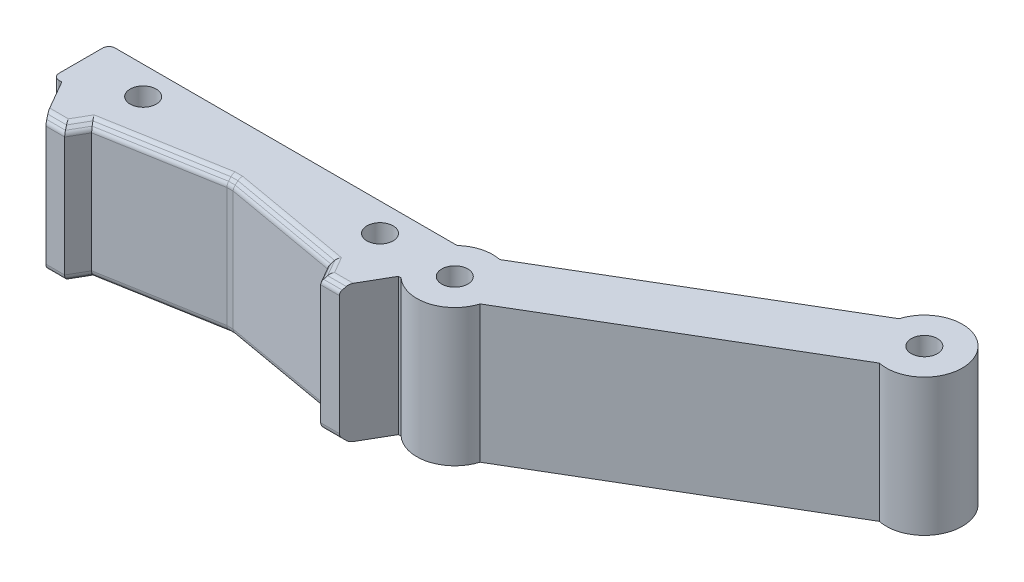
ISO-10303-21;
HEADER;
FILE_DESCRIPTION(('STEP AP214'),'2;1');
FILE_NAME('part.step','',(''),(''),'','','');
FILE_SCHEMA(('AUTOMOTIVE_DESIGN { 1 0 10303 214 1 1 1 1 }'));
ENDSEC;
DATA;
#1=APPLICATION_CONTEXT('core data for automotive mechanical design processes');
#2=APPLICATION_PROTOCOL_DEFINITION('international standard','automotive_design',2000,#1);
#3=PRODUCT_CONTEXT('',#1,'mechanical');
#4=PRODUCT('Part','Part','',(#3));
#5=PRODUCT_RELATED_PRODUCT_CATEGORY('part','',(#4));
#6=PRODUCT_DEFINITION_FORMATION('','',#4);
#7=PRODUCT_DEFINITION_CONTEXT('part definition',#1,'design');
#8=PRODUCT_DEFINITION('design','',#6,#7);
#9=PRODUCT_DEFINITION_SHAPE('','',#8);
#10=(LENGTH_UNIT() NAMED_UNIT(*) SI_UNIT(.MILLI.,.METRE.));
#11=(NAMED_UNIT(*) PLANE_ANGLE_UNIT() SI_UNIT($,.RADIAN.));
#12=(NAMED_UNIT(*) SI_UNIT($,.STERADIAN.) SOLID_ANGLE_UNIT());
#13=UNCERTAINTY_MEASURE_WITH_UNIT(LENGTH_MEASURE(1.E-05),#10,'distance_accuracy_value','');
#14=(GEOMETRIC_REPRESENTATION_CONTEXT(3) GLOBAL_UNCERTAINTY_ASSIGNED_CONTEXT((#13)) GLOBAL_UNIT_ASSIGNED_CONTEXT((#10,
#11,#12)) REPRESENTATION_CONTEXT('',''));
#15=CARTESIAN_POINT('',(0.,0.,0.));
#16=DIRECTION('',(0.,0.,1.));
#17=DIRECTION('',(1.,0.,0.));
#18=AXIS2_PLACEMENT_3D('',#15,#16,#17);
#19=CARTESIAN_POINT('',(-4.1182520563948,11.,4.5));
#20=DIRECTION('',(0.,0.,-1.));
#21=DIRECTION('',(-1.,0.,0.));
#22=AXIS2_PLACEMENT_3D('',#19,#20,#21);
#23=PLANE('',#22);
#24=DIRECTION('',(1.,0.,0.));
#25=VECTOR('',#24,1.);
#26=CARTESIAN_POINT('',(-4.1182520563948,11.,4.5));
#27=LINE('',#26,#25);
#28=CARTESIAN_POINT('',(-4.5591260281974,11.,4.5));
#29=VERTEX_POINT('',#28);
#30=CARTESIAN_POINT('',(-4.1182520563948,11.,4.5));
#31=VERTEX_POINT('',#30);
#32=EDGE_CURVE('E336',#29,#31,#27,.T.);
#33=ORIENTED_EDGE('',*,*,#32,.F.);
#34=DIRECTION('',(0.,-1.,0.));
#35=VECTOR('',#34,1.);
#36=CARTESIAN_POINT('',(-4.5591260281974,38.1707563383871,4.50000000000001));
#37=LINE('',#36,#35);
#38=CARTESIAN_POINT('',(-4.5591260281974,-11.,4.50000000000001));
#39=VERTEX_POINT('',#38);
#40=EDGE_CURVE('E320',#29,#39,#37,.T.);
#41=ORIENTED_EDGE('',*,*,#40,.T.);
#42=DIRECTION('',(1.,0.,0.));
#43=VECTOR('',#42,1.);
#44=CARTESIAN_POINT('',(-4.1182520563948,-11.,4.5));
#45=LINE('',#44,#43);
#46=CARTESIAN_POINT('',(-4.1182520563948,-11.,4.5));
#47=VERTEX_POINT('',#46);
#48=EDGE_CURVE('E334',#39,#47,#45,.T.);
#49=ORIENTED_EDGE('',*,*,#48,.T.);
#50=DIRECTION('',(0.,-1.,0.));
#51=VECTOR('',#50,1.);
#52=CARTESIAN_POINT('',(-4.1182520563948,11.,4.5));
#53=LINE('',#52,#51);
#54=EDGE_CURVE('E354',#31,#47,#53,.T.);
#55=ORIENTED_EDGE('',*,*,#54,.F.);
#56=EDGE_LOOP('',(#33,#41,#49,#55));
#57=FACE_BOUND('',#56,.T.);
#58=ADVANCED_FACE('F32',(#57),#23,.F.);
#59=CARTESIAN_POINT('',(-59.,-11.,4.50000000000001));
#60=VERTEX_POINT('',#59);
#61=CARTESIAN_POINT('',(-58.5591260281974,-11.,4.50000000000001));
#62=VERTEX_POINT('',#61);
#63=EDGE_CURVE('E345',#60,#62,#45,.T.);
#64=ORIENTED_EDGE('',*,*,#63,.T.);
#65=DIRECTION('',(0.,-1.,0.));
#66=VECTOR('',#65,1.);
#67=CARTESIAN_POINT('',(-58.5591260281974,38.1707563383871,4.50000000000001));
#68=LINE('',#67,#66);
#69=CARTESIAN_POINT('',(-58.5591260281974,11.,4.50000000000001));
#70=VERTEX_POINT('',#69);
#71=EDGE_CURVE('E640',#70,#62,#68,.T.);
#72=ORIENTED_EDGE('',*,*,#71,.F.);
#73=CARTESIAN_POINT('',(-59.,11.,4.50000000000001));
#74=VERTEX_POINT('',#73);
#75=EDGE_CURVE('E357',#74,#70,#27,.T.);
#76=ORIENTED_EDGE('',*,*,#75,.F.);
#77=DIRECTION('',(0.,-1.,0.));
#78=VECTOR('',#77,1.);
#79=CARTESIAN_POINT('',(-59.,11.,4.50000000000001));
#80=LINE('',#79,#78);
#81=EDGE_CURVE('E356',#74,#60,#80,.T.);
#82=ORIENTED_EDGE('',*,*,#81,.T.);
#83=EDGE_LOOP('',(#64,#72,#76,#82));
#84=FACE_BOUND('',#83,.T.);
#85=ADVANCED_FACE('F738',(#84),#23,.F.);
#86=CARTESIAN_POINT('',(0.,11.,0.));
#87=DIRECTION('',(0.,-1.,0.));
#88=DIRECTION('',(0.,0.,-1.));
#89=AXIS2_PLACEMENT_3D('',#86,#87,#88);
#90=PLANE('',#89);
#91=DIRECTION('',(0.499999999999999,0.,0.866025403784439));
#92=VECTOR('',#91,1.);
#93=CARTESIAN_POINT('',(-55.0950244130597,11.,10.5));
#94=LINE('',#93,#92);
#95=CARTESIAN_POINT('',(-55.9115209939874,11.,9.08578643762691));
#96=VERTEX_POINT('',#95);
#97=EDGE_CURVE('E650',#70,#96,#94,.T.);
#98=ORIENTED_EDGE('',*,*,#97,.T.);
#99=DIRECTION('',(1.,0.,0.));
#100=VECTOR('',#99,1.);
#101=CARTESIAN_POINT('',(-52.6723746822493,11.,9.08578643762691));
#102=LINE('',#101,#100);
#103=CARTESIAN_POINT('',(-52.9115209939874,11.,9.08578643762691));
#104=VERTEX_POINT('',#103);
#105=EDGE_CURVE('E11',#96,#104,#102,.T.);
#106=ORIENTED_EDGE('',*,*,#105,.T.);
#107=DIRECTION('',(0.499999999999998,0.,-0.86602540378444));
#108=VECTOR('',#107,1.);
#109=CARTESIAN_POINT('',(-51.5007745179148,11.,6.64230186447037));
#110=LINE('',#109,#108);
#111=CARTESIAN_POINT('',(-51.4041990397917,11.,6.47502822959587));
#112=VERTEX_POINT('',#111);
#113=EDGE_CURVE('E41',#104,#112,#110,.T.);
#114=ORIENTED_EDGE('',*,*,#113,.T.);
#115=DIRECTION('',(0.984807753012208,0.,-0.173648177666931));
#116=VECTOR('',#115,1.);
#117=CARTESIAN_POINT('',(-32.2185421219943,11.,3.09207927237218));
#118=LINE('',#117,#116);
#119=CARTESIAN_POINT('',(-32.1828536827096,11.,3.08578643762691));
#120=VERTEX_POINT('',#119);
#121=EDGE_CURVE('E554',#112,#120,#118,.T.);
#122=ORIENTED_EDGE('',*,*,#121,.T.);
#123=DIRECTION('',(-1.,0.,0.));
#124=VECTOR('',#123,1.);
#125=CARTESIAN_POINT('',(-30.9716373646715,11.,3.08578643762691));
#126=LINE('',#125,#124);
#127=CARTESIAN_POINT('',(-30.9353983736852,11.,3.08578643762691));
#128=VERTEX_POINT('',#127);
#129=EDGE_CURVE('E552',#120,#128,#126,.F.);
#130=ORIENTED_EDGE('',*,*,#129,.T.);
#131=DIRECTION('',(0.984807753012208,0.,0.173648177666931));
#132=VECTOR('',#131,1.);
#133=CARTESIAN_POINT('',(-11.9042695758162,11.,6.44148791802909));
#134=LINE('',#133,#132);
#135=CARTESIAN_POINT('',(-11.7140530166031,11.,6.47502822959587));
#136=VERTEX_POINT('',#135);
#137=EDGE_CURVE('E550',#128,#136,#134,.T.);
#138=ORIENTED_EDGE('',*,*,#137,.T.);
#139=DIRECTION('',(0.499999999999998,0.,0.86602540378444));
#140=VECTOR('',#139,1.);
#141=CARTESIAN_POINT('',(-10.0871579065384,11.,9.29289321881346));
#142=LINE('',#141,#140);
#143=CARTESIAN_POINT('',(-10.2067310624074,11.,9.08578643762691));
#144=VERTEX_POINT('',#143);
#145=EDGE_CURVE('E548',#136,#144,#142,.T.);
#146=ORIENTED_EDGE('',*,*,#145,.T.);
#147=DIRECTION('',(1.,0.,0.));
#148=VECTOR('',#147,1.);
#149=CARTESIAN_POINT('',(-7.44587737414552,11.,9.08578643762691));
#150=LINE('',#149,#148);
#151=CARTESIAN_POINT('',(-7.20673106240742,11.,9.08578643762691));
#152=VERTEX_POINT('',#151);
#153=EDGE_CURVE('E546',#144,#152,#150,.T.);
#154=ORIENTED_EDGE('',*,*,#153,.T.);
#155=DIRECTION('',(0.499999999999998,0.,-0.86602540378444));
#156=VECTOR('',#155,1.);
#157=CARTESIAN_POINT('',(-8.02322764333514,11.,10.5));
#158=LINE('',#157,#156);
#159=EDGE_CURVE('E635',#152,#29,#158,.T.);
#160=ORIENTED_EDGE('',*,*,#159,.T.);
#161=ORIENTED_EDGE('',*,*,#32,.T.);
#162=CARTESIAN_POINT('',(0.,11.,0.));
#163=DIRECTION('',(0.,1.,0.));
#164=DIRECTION('',(0.,0.,-1.));
#165=AXIS2_PLACEMENT_3D('',#162,#163,#164);
#166=CIRCLE('',#165,6.1);
#167=CARTESIAN_POINT('',(5.83554116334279,11.,1.77664271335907));
#168=VERTEX_POINT('',#167);
#169=EDGE_CURVE('E349',#31,#168,#166,.T.);
#170=ORIENTED_EDGE('',*,*,#169,.T.);
#171=DIRECTION('',(0.860712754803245,0.,-0.509090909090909));
#172=VECTOR('',#171,1.);
#173=CARTESIAN_POINT('',(5.83554116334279,11.,1.77664271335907));
#174=LINE('',#173,#172);
#175=CARTESIAN_POINT('',(46.0854785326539,11.,-22.0302279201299));
#176=VERTEX_POINT('',#175);
#177=EDGE_CURVE('E692',#168,#176,#174,.T.);
#178=ORIENTED_EDGE('',*,*,#177,.T.);
#179=CARTESIAN_POINT('',(47.3392015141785,11.,-28.));
#180=DIRECTION('',(0.,1.,0.));
#181=DIRECTION('',(0.,0.,-1.));
#182=AXIS2_PLACEMENT_3D('',#179,#180,#181);
#183=CIRCLE('',#182,6.1);
#184=CARTESIAN_POINT('',(41.5036603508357,11.,-29.7766427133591));
#185=VERTEX_POINT('',#184);
#186=EDGE_CURVE('E694',#176,#185,#183,.T.);
#187=ORIENTED_EDGE('',*,*,#186,.T.);
#188=DIRECTION('',(-0.860712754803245,0.,0.509090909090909));
#189=VECTOR('',#188,1.);
#190=CARTESIAN_POINT('',(41.5036603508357,11.,-29.7766427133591));
#191=LINE('',#190,#189);
#192=CARTESIAN_POINT('',(1.25372298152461,11.,-5.96977207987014));
#193=VERTEX_POINT('',#192);
#194=EDGE_CURVE('E696',#185,#193,#191,.T.);
#195=ORIENTED_EDGE('',*,*,#194,.T.);
#196=CARTESIAN_POINT('',(0.,11.,0.));
#197=DIRECTION('',(0.,1.,0.));
#198=DIRECTION('',(0.,0.,-1.));
#199=AXIS2_PLACEMENT_3D('',#196,#197,#198);
#200=CIRCLE('',#199,6.1);
#201=CARTESIAN_POINT('',(-4.1182520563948,11.,-4.5));
#202=VERTEX_POINT('',#201);
#203=EDGE_CURVE('E698',#193,#202,#200,.T.);
#204=ORIENTED_EDGE('',*,*,#203,.T.);
#205=DIRECTION('',(-1.,0.,0.));
#206=VECTOR('',#205,1.);
#207=CARTESIAN_POINT('',(-59.,11.,-4.49999999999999));
#208=LINE('',#207,#206);
#209=CARTESIAN_POINT('',(-59.,11.,-4.49999999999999));
#210=VERTEX_POINT('',#209);
#211=EDGE_CURVE('E700',#202,#210,#208,.T.);
#212=ORIENTED_EDGE('',*,*,#211,.T.);
#213=CARTESIAN_POINT('',(-59.,11.,-3.49999999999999));
#214=DIRECTION('',(0.,1.,0.));
#215=DIRECTION('',(0.,0.,-1.));
#216=AXIS2_PLACEMENT_3D('',#213,#214,#215);
#217=CIRCLE('',#216,1.);
#218=CARTESIAN_POINT('',(-60.,11.,-3.49999999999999));
#219=VERTEX_POINT('',#218);
#220=EDGE_CURVE('E702',#210,#219,#217,.T.);
#221=ORIENTED_EDGE('',*,*,#220,.T.);
#222=DIRECTION('',(0.,0.,1.));
#223=VECTOR('',#222,1.);
#224=CARTESIAN_POINT('',(-60.,11.,3.50000000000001));
#225=LINE('',#224,#223);
#226=CARTESIAN_POINT('',(-60.,11.,3.50000000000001));
#227=VERTEX_POINT('',#226);
#228=EDGE_CURVE('E704',#219,#227,#225,.T.);
#229=ORIENTED_EDGE('',*,*,#228,.T.);
#230=CARTESIAN_POINT('',(-59.,11.,3.50000000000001));
#231=DIRECTION('',(0.,1.,0.));
#232=DIRECTION('',(0.,0.,-1.));
#233=AXIS2_PLACEMENT_3D('',#230,#231,#232);
#234=CIRCLE('',#233,1.);
#235=EDGE_CURVE('E706',#227,#74,#234,.T.);
#236=ORIENTED_EDGE('',*,*,#235,.T.);
#237=ORIENTED_EDGE('',*,*,#75,.T.);
#238=EDGE_LOOP('',(#98,#106,#114,#122,#130,#138,#146,#154,#160,#161,#170,#178,#187,#195,#204,
#212,#221,#229,#236,#237));
#239=FACE_BOUND('',#238,.T.);
#240=CARTESIAN_POINT('',(0.,11.,0.));
#241=DIRECTION('',(0.,1.,0.));
#242=DIRECTION('',(0.,0.,1.));
#243=AXIS2_PLACEMENT_3D('',#240,#241,#242);
#244=CIRCLE('',#243,2.1);
#245=CARTESIAN_POINT('',(0.,11.,2.1));
#246=VERTEX_POINT('',#245);
#247=EDGE_CURVE('E685',#246,#246,#244,.T.);
#248=ORIENTED_EDGE('',*,*,#247,.F.);
#249=EDGE_LOOP('',(#248));
#250=FACE_BOUND('',#249,.T.);
#251=CARTESIAN_POINT('',(47.3392015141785,11.,-28.));
#252=DIRECTION('',(0.,1.,0.));
#253=DIRECTION('',(0.,0.,1.));
#254=AXIS2_PLACEMENT_3D('',#251,#252,#253);
#255=CIRCLE('',#254,2.1);
#256=CARTESIAN_POINT('',(47.3392015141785,11.,-25.9));
#257=VERTEX_POINT('',#256);
#258=EDGE_CURVE('E679',#257,#257,#255,.T.);
#259=ORIENTED_EDGE('',*,*,#258,.F.);
#260=EDGE_LOOP('',(#259));
#261=FACE_BOUND('',#260,.T.);
#262=CARTESIAN_POINT('',(-12.,11.,0.));
#263=DIRECTION('',(0.,1.,0.));
#264=DIRECTION('',(0.,0.,1.));
#265=AXIS2_PLACEMENT_3D('',#262,#263,#264);
#266=CIRCLE('',#265,2.1);
#267=CARTESIAN_POINT('',(-12.,11.,2.1));
#268=VERTEX_POINT('',#267);
#269=EDGE_CURVE('E673',#268,#268,#266,.T.);
#270=ORIENTED_EDGE('',*,*,#269,.F.);
#271=EDGE_LOOP('',(#270));
#272=FACE_BOUND('',#271,.T.);
#273=CARTESIAN_POINT('',(-50.,11.,0.));
#274=DIRECTION('',(0.,1.,0.));
#275=DIRECTION('',(0.,0.,1.));
#276=AXIS2_PLACEMENT_3D('',#273,#274,#275);
#277=CIRCLE('',#276,2.1);
#278=CARTESIAN_POINT('',(-50.,11.,2.10000000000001));
#279=VERTEX_POINT('',#278);
#280=EDGE_CURVE('E667',#279,#279,#277,.T.);
#281=ORIENTED_EDGE('',*,*,#280,.F.);
#282=EDGE_LOOP('',(#281));
#283=FACE_BOUND('',#282,.T.);
#284=ADVANCED_FACE('F633',(#239,#250,#261,#272,#283),#90,.F.);
#285=CARTESIAN_POINT('',(0.,-11.,0.));
#286=DIRECTION('',(0.,-1.,0.));
#287=DIRECTION('',(0.,0.,-1.));
#288=AXIS2_PLACEMENT_3D('',#285,#286,#287);
#289=PLANE('',#288);
#290=DIRECTION('',(-0.499999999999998,0.,0.86602540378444));
#291=VECTOR('',#290,1.);
#292=CARTESIAN_POINT('',(-8.02322764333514,-11.,10.5));
#293=LINE('',#292,#291);
#294=CARTESIAN_POINT('',(-7.2067310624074,-11.,9.08578643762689));
#295=VERTEX_POINT('',#294);
#296=EDGE_CURVE('E315',#39,#295,#293,.T.);
#297=ORIENTED_EDGE('',*,*,#296,.T.);
#298=DIRECTION('',(1.,0.,0.));
#299=VECTOR('',#298,1.);
#300=CARTESIAN_POINT('',(0.,-11.,9.08578643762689));
#301=LINE('',#300,#299);
#302=CARTESIAN_POINT('',(-10.2067310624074,-11.,9.08578643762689));
#303=VERTEX_POINT('',#302);
#304=EDGE_CURVE('E516',#295,#303,#301,.F.);
#305=ORIENTED_EDGE('',*,*,#304,.T.);
#306=DIRECTION('',(0.499999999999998,0.,0.86602540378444));
#307=VECTOR('',#306,1.);
#308=CARTESIAN_POINT('',(-11.5893092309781,-11.,6.69109080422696));
#309=LINE('',#308,#307);
#310=CARTESIAN_POINT('',(-11.7140530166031,-11.,6.47502822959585));
#311=VERTEX_POINT('',#310);
#312=EDGE_CURVE('E514',#303,#311,#309,.F.);
#313=ORIENTED_EDGE('',*,*,#312,.T.);
#314=DIRECTION('',(0.984807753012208,0.,0.173648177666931));
#315=VECTOR('',#314,1.);
#316=CARTESIAN_POINT('',(-1.4605169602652,-11.,8.28300328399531));
#317=LINE('',#316,#315);
#318=CARTESIAN_POINT('',(-30.9353983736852,-11.,3.08578643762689));
#319=VERTEX_POINT('',#318);
#320=EDGE_CURVE('E512',#311,#319,#317,.F.);
#321=ORIENTED_EDGE('',*,*,#320,.T.);
#322=DIRECTION('',(-1.,0.,0.));
#323=VECTOR('',#322,1.);
#324=CARTESIAN_POINT('',(0.,-11.,3.08578643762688));
#325=LINE('',#324,#323);
#326=CARTESIAN_POINT('',(-32.1828536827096,-11.,3.08578643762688));
#327=VERTEX_POINT('',#326);
#328=EDGE_CURVE('E510',#319,#327,#325,.T.);
#329=ORIENTED_EDGE('',*,*,#328,.T.);
#330=DIRECTION('',(0.984807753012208,0.,-0.173648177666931));
#331=VECTOR('',#330,1.);
#332=CARTESIAN_POINT('',(-0.442731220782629,-11.,-2.51085352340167));
#333=LINE('',#332,#331);
#334=CARTESIAN_POINT('',(-51.4041990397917,-11.,6.47502822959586));
#335=VERTEX_POINT('',#334);
#336=EDGE_CURVE('E508',#327,#335,#333,.F.);
#337=ORIENTED_EDGE('',*,*,#336,.T.);
#338=DIRECTION('',(0.499999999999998,0.,-0.86602540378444));
#339=VECTOR('',#338,1.);
#340=CARTESIAN_POINT('',(-35.7493798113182,-11.,-20.6399140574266));
#341=LINE('',#340,#339);
#342=CARTESIAN_POINT('',(-52.9115209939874,-11.,9.08578643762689));
#343=VERTEX_POINT('',#342);
#344=EDGE_CURVE('E506',#335,#343,#341,.F.);
#345=ORIENTED_EDGE('',*,*,#344,.T.);
#346=DIRECTION('',(1.,0.,0.));
#347=VECTOR('',#346,1.);
#348=CARTESIAN_POINT('',(0.,-11.,9.08578643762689));
#349=LINE('',#348,#347);
#350=CARTESIAN_POINT('',(-55.9115209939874,-11.,9.08578643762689));
#351=VERTEX_POINT('',#350);
#352=EDGE_CURVE('E504',#343,#351,#349,.F.);
#353=ORIENTED_EDGE('',*,*,#352,.T.);
#354=DIRECTION('',(-0.499999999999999,0.,-0.866025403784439));
#355=VECTOR('',#354,1.);
#356=CARTESIAN_POINT('',(-55.0950244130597,-11.,10.5));
#357=LINE('',#356,#355);
#358=EDGE_CURVE('E637',#351,#62,#357,.T.);
#359=ORIENTED_EDGE('',*,*,#358,.T.);
#360=ORIENTED_EDGE('',*,*,#63,.F.);
#361=CARTESIAN_POINT('',(-59.,-11.,3.50000000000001));
#362=DIRECTION('',(0.,1.,0.));
#363=DIRECTION('',(0.,0.,-1.));
#364=AXIS2_PLACEMENT_3D('',#361,#362,#363);
#365=CIRCLE('',#364,1.);
#366=CARTESIAN_POINT('',(-60.,-11.,3.50000000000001));
#367=VERTEX_POINT('',#366);
#368=EDGE_CURVE('E346',#367,#60,#365,.T.);
#369=ORIENTED_EDGE('',*,*,#368,.F.);
#370=DIRECTION('',(0.,0.,1.));
#371=VECTOR('',#370,1.);
#372=CARTESIAN_POINT('',(-60.,-11.,3.50000000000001));
#373=LINE('',#372,#371);
#374=CARTESIAN_POINT('',(-60.,-11.,-3.49999999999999));
#375=VERTEX_POINT('',#374);
#376=EDGE_CURVE('E350',#375,#367,#373,.T.);
#377=ORIENTED_EDGE('',*,*,#376,.F.);
#378=CARTESIAN_POINT('',(-59.,-11.,-3.49999999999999));
#379=DIRECTION('',(0.,1.,0.));
#380=DIRECTION('',(0.,0.,-1.));
#381=AXIS2_PLACEMENT_3D('',#378,#379,#380);
#382=CIRCLE('',#381,1.);
#383=CARTESIAN_POINT('',(-59.,-11.,-4.49999999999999));
#384=VERTEX_POINT('',#383);
#385=EDGE_CURVE('E721',#384,#375,#382,.T.);
#386=ORIENTED_EDGE('',*,*,#385,.F.);
#387=DIRECTION('',(-1.,0.,0.));
#388=VECTOR('',#387,1.);
#389=CARTESIAN_POINT('',(-59.,-11.,-4.49999999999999));
#390=LINE('',#389,#388);
#391=CARTESIAN_POINT('',(-4.1182520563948,-11.,-4.5));
#392=VERTEX_POINT('',#391);
#393=EDGE_CURVE('E719',#392,#384,#390,.T.);
#394=ORIENTED_EDGE('',*,*,#393,.F.);
#395=CARTESIAN_POINT('',(0.,-11.,0.));
#396=DIRECTION('',(0.,1.,0.));
#397=DIRECTION('',(0.,0.,-1.));
#398=AXIS2_PLACEMENT_3D('',#395,#396,#397);
#399=CIRCLE('',#398,6.1);
#400=CARTESIAN_POINT('',(1.25372298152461,-11.,-5.96977207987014));
#401=VERTEX_POINT('',#400);
#402=EDGE_CURVE('E717',#401,#392,#399,.T.);
#403=ORIENTED_EDGE('',*,*,#402,.F.);
#404=DIRECTION('',(-0.860712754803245,0.,0.509090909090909));
#405=VECTOR('',#404,1.);
#406=CARTESIAN_POINT('',(41.5036603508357,-11.,-29.7766427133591));
#407=LINE('',#406,#405);
#408=CARTESIAN_POINT('',(41.5036603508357,-11.,-29.7766427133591));
#409=VERTEX_POINT('',#408);
#410=EDGE_CURVE('E715',#409,#401,#407,.T.);
#411=ORIENTED_EDGE('',*,*,#410,.F.);
#412=CARTESIAN_POINT('',(47.3392015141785,-11.,-28.));
#413=DIRECTION('',(0.,1.,0.));
#414=DIRECTION('',(0.,0.,-1.));
#415=AXIS2_PLACEMENT_3D('',#412,#413,#414);
#416=CIRCLE('',#415,6.1);
#417=CARTESIAN_POINT('',(46.0854785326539,-11.,-22.0302279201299));
#418=VERTEX_POINT('',#417);
#419=EDGE_CURVE('E713',#418,#409,#416,.T.);
#420=ORIENTED_EDGE('',*,*,#419,.F.);
#421=DIRECTION('',(0.860712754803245,0.,-0.509090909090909));
#422=VECTOR('',#421,1.);
#423=CARTESIAN_POINT('',(5.83554116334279,-11.,1.77664271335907));
#424=LINE('',#423,#422);
#425=CARTESIAN_POINT('',(5.83554116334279,-11.,1.77664271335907));
#426=VERTEX_POINT('',#425);
#427=EDGE_CURVE('E711',#426,#418,#424,.T.);
#428=ORIENTED_EDGE('',*,*,#427,.F.);
#429=CARTESIAN_POINT('',(0.,-11.,0.));
#430=DIRECTION('',(0.,1.,0.));
#431=DIRECTION('',(0.,0.,-1.));
#432=AXIS2_PLACEMENT_3D('',#429,#430,#431);
#433=CIRCLE('',#432,6.1);
#434=EDGE_CURVE('E344',#47,#426,#433,.T.);
#435=ORIENTED_EDGE('',*,*,#434,.F.);
#436=ORIENTED_EDGE('',*,*,#48,.F.);
#437=EDGE_LOOP('',(#297,#305,#313,#321,#329,#337,#345,#353,#359,#360,#369,#377,#386,#394,#403,
#411,#420,#428,#435,#436));
#438=FACE_BOUND('',#437,.T.);
#439=CARTESIAN_POINT('',(-12.,-11.,0.));
#440=DIRECTION('',(0.,1.,0.));
#441=DIRECTION('',(0.,0.,1.));
#442=AXIS2_PLACEMENT_3D('',#439,#440,#441);
#443=CIRCLE('',#442,2.1);
#444=CARTESIAN_POINT('',(-12.,-11.,2.1));
#445=VERTEX_POINT('',#444);
#446=EDGE_CURVE('E670',#445,#445,#443,.T.);
#447=ORIENTED_EDGE('',*,*,#446,.T.);
#448=EDGE_LOOP('',(#447));
#449=FACE_BOUND('',#448,.T.);
#450=CARTESIAN_POINT('',(0.,-11.,0.));
#451=DIRECTION('',(0.,1.,0.));
#452=DIRECTION('',(0.,0.,1.));
#453=AXIS2_PLACEMENT_3D('',#450,#451,#452);
#454=CIRCLE('',#453,2.1);
#455=CARTESIAN_POINT('',(0.,-11.,2.1));
#456=VERTEX_POINT('',#455);
#457=EDGE_CURVE('E682',#456,#456,#454,.T.);
#458=ORIENTED_EDGE('',*,*,#457,.T.);
#459=EDGE_LOOP('',(#458));
#460=FACE_BOUND('',#459,.T.);
#461=CARTESIAN_POINT('',(47.3392015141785,-11.,-28.));
#462=DIRECTION('',(0.,1.,0.));
#463=DIRECTION('',(0.,0.,1.));
#464=AXIS2_PLACEMENT_3D('',#461,#462,#463);
#465=CIRCLE('',#464,2.1);
#466=CARTESIAN_POINT('',(47.3392015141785,-11.,-25.9));
#467=VERTEX_POINT('',#466);
#468=EDGE_CURVE('E676',#467,#467,#465,.T.);
#469=ORIENTED_EDGE('',*,*,#468,.T.);
#470=EDGE_LOOP('',(#469));
#471=FACE_BOUND('',#470,.T.);
#472=CARTESIAN_POINT('',(-50.,-11.,0.));
#473=DIRECTION('',(0.,1.,0.));
#474=DIRECTION('',(0.,0.,1.));
#475=AXIS2_PLACEMENT_3D('',#472,#473,#474);
#476=CIRCLE('',#475,2.1);
#477=CARTESIAN_POINT('',(-50.,-11.,2.10000000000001));
#478=VERTEX_POINT('',#477);
#479=EDGE_CURVE('E651',#478,#478,#476,.T.);
#480=ORIENTED_EDGE('',*,*,#479,.T.);
#481=EDGE_LOOP('',(#480));
#482=FACE_BOUND('',#481,.T.);
#483=ADVANCED_FACE('F341',(#438,#449,#460,#471,#482),#289,.T.);
#484=CARTESIAN_POINT('',(0.,11.,0.));
#485=DIRECTION('',(0.,-1.,0.));
#486=DIRECTION('',(0.,0.,-1.));
#487=AXIS2_PLACEMENT_3D('',#484,#485,#486);
#488=CYLINDRICAL_SURFACE('',#487,6.1);
#489=ORIENTED_EDGE('',*,*,#434,.T.);
#490=DIRECTION('',(0.,-1.,0.));
#491=VECTOR('',#490,1.);
#492=CARTESIAN_POINT('',(5.83554116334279,11.,1.77664271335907));
#493=LINE('',#492,#491);
#494=EDGE_CURVE('E381',#168,#426,#493,.T.);
#495=ORIENTED_EDGE('',*,*,#494,.F.);
#496=ORIENTED_EDGE('',*,*,#169,.F.);
#497=ORIENTED_EDGE('',*,*,#54,.T.);
#498=EDGE_LOOP('',(#489,#495,#496,#497));
#499=FACE_BOUND('',#498,.T.);
#500=ADVANCED_FACE('F769',(#499),#488,.T.);
#501=CARTESIAN_POINT('',(5.83554116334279,11.,1.77664271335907));
#502=DIRECTION('',(-0.509090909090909,0.,-0.860712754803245));
#503=DIRECTION('',(-0.860712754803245,0.,0.509090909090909));
#504=AXIS2_PLACEMENT_3D('',#501,#502,#503);
#505=PLANE('',#504);
#506=ORIENTED_EDGE('',*,*,#427,.T.);
#507=DIRECTION('',(0.,-1.,0.));
#508=VECTOR('',#507,1.);
#509=CARTESIAN_POINT('',(46.0854785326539,11.,-22.0302279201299));
#510=LINE('',#509,#508);
#511=EDGE_CURVE('E378',#176,#418,#510,.T.);
#512=ORIENTED_EDGE('',*,*,#511,.F.);
#513=ORIENTED_EDGE('',*,*,#177,.F.);
#514=ORIENTED_EDGE('',*,*,#494,.T.);
#515=EDGE_LOOP('',(#506,#512,#513,#514));
#516=FACE_BOUND('',#515,.T.);
#517=ADVANCED_FACE('F765',(#516),#505,.F.);
#518=CARTESIAN_POINT('',(47.3392015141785,11.,-28.));
#519=DIRECTION('',(0.,-1.,0.));
#520=DIRECTION('',(0.,0.,-1.));
#521=AXIS2_PLACEMENT_3D('',#518,#519,#520);
#522=CYLINDRICAL_SURFACE('',#521,6.1);
#523=ORIENTED_EDGE('',*,*,#419,.T.);
#524=DIRECTION('',(0.,-1.,0.));
#525=VECTOR('',#524,1.);
#526=CARTESIAN_POINT('',(41.5036603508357,11.,-29.7766427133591));
#527=LINE('',#526,#525);
#528=EDGE_CURVE('E375',#185,#409,#527,.T.);
#529=ORIENTED_EDGE('',*,*,#528,.F.);
#530=ORIENTED_EDGE('',*,*,#186,.F.);
#531=ORIENTED_EDGE('',*,*,#511,.T.);
#532=EDGE_LOOP('',(#523,#529,#530,#531));
#533=FACE_BOUND('',#532,.T.);
#534=ADVANCED_FACE('F761',(#533),#522,.T.);
#535=CARTESIAN_POINT('',(41.5036603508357,11.,-29.7766427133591));
#536=DIRECTION('',(0.509090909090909,0.,0.860712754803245));
#537=DIRECTION('',(0.860712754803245,0.,-0.509090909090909));
#538=AXIS2_PLACEMENT_3D('',#535,#536,#537);
#539=PLANE('',#538);
#540=ORIENTED_EDGE('',*,*,#410,.T.);
#541=DIRECTION('',(0.,-1.,0.));
#542=VECTOR('',#541,1.);
#543=CARTESIAN_POINT('',(1.25372298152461,11.,-5.96977207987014));
#544=LINE('',#543,#542);
#545=EDGE_CURVE('E372',#193,#401,#544,.T.);
#546=ORIENTED_EDGE('',*,*,#545,.F.);
#547=ORIENTED_EDGE('',*,*,#194,.F.);
#548=ORIENTED_EDGE('',*,*,#528,.T.);
#549=EDGE_LOOP('',(#540,#546,#547,#548));
#550=FACE_BOUND('',#549,.T.);
#551=ADVANCED_FACE('F757',(#550),#539,.F.);
#552=CARTESIAN_POINT('',(0.,11.,0.));
#553=DIRECTION('',(0.,-1.,0.));
#554=DIRECTION('',(0.,0.,-1.));
#555=AXIS2_PLACEMENT_3D('',#552,#553,#554);
#556=CYLINDRICAL_SURFACE('',#555,6.1);
#557=ORIENTED_EDGE('',*,*,#402,.T.);
#558=DIRECTION('',(0.,-1.,0.));
#559=VECTOR('',#558,1.);
#560=CARTESIAN_POINT('',(-4.1182520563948,11.,-4.5));
#561=LINE('',#560,#559);
#562=EDGE_CURVE('E369',#202,#392,#561,.T.);
#563=ORIENTED_EDGE('',*,*,#562,.F.);
#564=ORIENTED_EDGE('',*,*,#203,.F.);
#565=ORIENTED_EDGE('',*,*,#545,.T.);
#566=EDGE_LOOP('',(#557,#563,#564,#565));
#567=FACE_BOUND('',#566,.T.);
#568=ADVANCED_FACE('F753',(#567),#556,.T.);
#569=CARTESIAN_POINT('',(-59.,11.,-4.49999999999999));
#570=DIRECTION('',(0.,0.,1.));
#571=DIRECTION('',(1.,0.,0.));
#572=AXIS2_PLACEMENT_3D('',#569,#570,#571);
#573=PLANE('',#572);
#574=ORIENTED_EDGE('',*,*,#393,.T.);
#575=DIRECTION('',(0.,-1.,0.));
#576=VECTOR('',#575,1.);
#577=CARTESIAN_POINT('',(-59.,11.,-4.49999999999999));
#578=LINE('',#577,#576);
#579=EDGE_CURVE('E366',#210,#384,#578,.T.);
#580=ORIENTED_EDGE('',*,*,#579,.F.);
#581=ORIENTED_EDGE('',*,*,#211,.F.);
#582=ORIENTED_EDGE('',*,*,#562,.T.);
#583=EDGE_LOOP('',(#574,#580,#581,#582));
#584=FACE_BOUND('',#583,.T.);
#585=ADVANCED_FACE('F749',(#584),#573,.F.);
#586=CARTESIAN_POINT('',(-59.,11.,-3.49999999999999));
#587=DIRECTION('',(0.,-1.,0.));
#588=DIRECTION('',(0.,0.,-1.));
#589=AXIS2_PLACEMENT_3D('',#586,#587,#588);
#590=CYLINDRICAL_SURFACE('',#589,1.);
#591=ORIENTED_EDGE('',*,*,#385,.T.);
#592=DIRECTION('',(0.,-1.,0.));
#593=VECTOR('',#592,1.);
#594=CARTESIAN_POINT('',(-60.,11.,-3.49999999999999));
#595=LINE('',#594,#593);
#596=EDGE_CURVE('E363',#219,#375,#595,.T.);
#597=ORIENTED_EDGE('',*,*,#596,.F.);
#598=ORIENTED_EDGE('',*,*,#220,.F.);
#599=ORIENTED_EDGE('',*,*,#579,.T.);
#600=EDGE_LOOP('',(#591,#597,#598,#599));
#601=FACE_BOUND('',#600,.T.);
#602=ADVANCED_FACE('F744',(#601),#590,.T.);
#603=CARTESIAN_POINT('',(-60.,11.,3.50000000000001));
#604=DIRECTION('',(1.,0.,0.));
#605=DIRECTION('',(0.,0.,-1.));
#606=AXIS2_PLACEMENT_3D('',#603,#604,#605);
#607=PLANE('',#606);
#608=ORIENTED_EDGE('',*,*,#376,.T.);
#609=DIRECTION('',(0.,-1.,0.));
#610=VECTOR('',#609,1.);
#611=CARTESIAN_POINT('',(-60.,11.,3.50000000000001));
#612=LINE('',#611,#610);
#613=EDGE_CURVE('E360',#227,#367,#612,.T.);
#614=ORIENTED_EDGE('',*,*,#613,.F.);
#615=ORIENTED_EDGE('',*,*,#228,.F.);
#616=ORIENTED_EDGE('',*,*,#596,.T.);
#617=EDGE_LOOP('',(#608,#614,#615,#616));
#618=FACE_BOUND('',#617,.T.);
#619=ADVANCED_FACE('F725',(#618),#607,.F.);
#620=CARTESIAN_POINT('',(-59.,11.,3.50000000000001));
#621=DIRECTION('',(0.,-1.,0.));
#622=DIRECTION('',(0.,0.,-1.));
#623=AXIS2_PLACEMENT_3D('',#620,#621,#622);
#624=CYLINDRICAL_SURFACE('',#623,1.);
#625=ORIENTED_EDGE('',*,*,#368,.T.);
#626=ORIENTED_EDGE('',*,*,#81,.F.);
#627=ORIENTED_EDGE('',*,*,#235,.F.);
#628=ORIENTED_EDGE('',*,*,#613,.T.);
#629=EDGE_LOOP('',(#625,#626,#627,#628));
#630=FACE_BOUND('',#629,.T.);
#631=ADVANCED_FACE('F732',(#630),#624,.T.);
#632=DIRECTION('',(0.,-1.,0.));
#633=VECTOR('',#632,1.);
#634=CARTESIAN_POINT('',(-32.0591260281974,38.1707563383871,4.50000000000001));
#635=LINE('',#634,#633);
#636=CARTESIAN_POINT('',(-32.0591260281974,9.58578643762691,4.50000000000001));
#637=VERTEX_POINT('',#636);
#638=CARTESIAN_POINT('',(-32.0591260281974,-9.58578643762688,4.50000000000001));
#639=VERTEX_POINT('',#638);
#640=EDGE_CURVE('E662',#637,#639,#635,.T.);
#641=ORIENTED_EDGE('',*,*,#640,.T.);
#642=DIRECTION('',(1.,0.,0.));
#643=VECTOR('',#642,1.);
#644=CARTESIAN_POINT('',(-31.0591260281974,-9.58578643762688,4.5));
#645=LINE('',#644,#643);
#646=CARTESIAN_POINT('',(-31.0591260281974,-9.58578643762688,4.50000000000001));
#647=VERTEX_POINT('',#646);
#648=EDGE_CURVE('E466',#639,#647,#645,.T.);
#649=ORIENTED_EDGE('',*,*,#648,.T.);
#650=DIRECTION('',(0.,-1.,0.));
#651=VECTOR('',#650,1.);
#652=CARTESIAN_POINT('',(-31.0591260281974,38.1707563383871,4.50000000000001));
#653=LINE('',#652,#651);
#654=CARTESIAN_POINT('',(-31.0591260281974,9.58578643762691,4.50000000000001));
#655=VERTEX_POINT('',#654);
#656=EDGE_CURVE('E338',#655,#647,#653,.T.);
#657=ORIENTED_EDGE('',*,*,#656,.F.);
#658=DIRECTION('',(1.,0.,0.));
#659=VECTOR('',#658,1.);
#660=CARTESIAN_POINT('',(-32.0591260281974,9.5857864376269,4.5));
#661=LINE('',#660,#659);
#662=EDGE_CURVE('E464',#655,#637,#661,.F.);
#663=ORIENTED_EDGE('',*,*,#662,.T.);
#664=EDGE_LOOP('',(#641,#649,#657,#663));
#665=FACE_BOUND('',#664,.T.);
#666=ADVANCED_FACE('F781',(#665),#23,.F.);
#667=CARTESIAN_POINT('',(0.,11.,0.));
#668=DIRECTION('',(0.,-1.,0.));
#669=DIRECTION('',(0.,0.,-1.));
#670=AXIS2_PLACEMENT_3D('',#667,#668,#669);
#671=CYLINDRICAL_SURFACE('',#670,2.1);
#672=ORIENTED_EDGE('',*,*,#247,.T.);
#673=EDGE_LOOP('',(#672));
#674=FACE_BOUND('',#673,.T.);
#675=ORIENTED_EDGE('',*,*,#457,.F.);
#676=EDGE_LOOP('',(#675));
#677=FACE_BOUND('',#676,.T.);
#678=ADVANCED_FACE('F787',(#674,#677),#671,.F.);
#679=CARTESIAN_POINT('',(47.3392015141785,11.,-28.));
#680=DIRECTION('',(0.,-1.,0.));
#681=DIRECTION('',(0.,0.,-1.));
#682=AXIS2_PLACEMENT_3D('',#679,#680,#681);
#683=CYLINDRICAL_SURFACE('',#682,2.1);
#684=ORIENTED_EDGE('',*,*,#258,.T.);
#685=EDGE_LOOP('',(#684));
#686=FACE_BOUND('',#685,.T.);
#687=ORIENTED_EDGE('',*,*,#468,.F.);
#688=EDGE_LOOP('',(#687));
#689=FACE_BOUND('',#688,.T.);
#690=ADVANCED_FACE('F793',(#686,#689),#683,.F.);
#691=CARTESIAN_POINT('',(-12.,11.,0.));
#692=DIRECTION('',(0.,-1.,0.));
#693=DIRECTION('',(0.,0.,-1.));
#694=AXIS2_PLACEMENT_3D('',#691,#692,#693);
#695=CYLINDRICAL_SURFACE('',#694,2.1);
#696=ORIENTED_EDGE('',*,*,#269,.T.);
#697=EDGE_LOOP('',(#696));
#698=FACE_BOUND('',#697,.T.);
#699=ORIENTED_EDGE('',*,*,#446,.F.);
#700=EDGE_LOOP('',(#699));
#701=FACE_BOUND('',#700,.T.);
#702=ADVANCED_FACE('F1327',(#698,#701),#695,.F.);
#703=CARTESIAN_POINT('',(-50.,11.,0.));
#704=DIRECTION('',(0.,-1.,0.));
#705=DIRECTION('',(0.,0.,-1.));
#706=AXIS2_PLACEMENT_3D('',#703,#704,#705);
#707=CYLINDRICAL_SURFACE('',#706,2.1);
#708=ORIENTED_EDGE('',*,*,#280,.T.);
#709=EDGE_LOOP('',(#708));
#710=FACE_BOUND('',#709,.T.);
#711=ORIENTED_EDGE('',*,*,#479,.F.);
#712=EDGE_LOOP('',(#711));
#713=FACE_BOUND('',#712,.T.);
#714=ADVANCED_FACE('F1285',(#710,#713),#707,.F.);
#715=CARTESIAN_POINT('',(-55.0950244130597,38.1707563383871,10.5));
#716=DIRECTION('',(-0.866025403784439,0.,0.499999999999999));
#717=DIRECTION('',(0.499999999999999,0.,0.866025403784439));
#718=AXIS2_PLACEMENT_3D('',#715,#716,#717);
#719=PLANE('',#718);
#720=DIRECTION('',(-0.377964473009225,-0.654653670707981,-0.654653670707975));
#721=VECTOR('',#720,1.);
#722=CARTESIAN_POINT('',(-43.175853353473,10.644609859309,31.1446098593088));
#723=LINE('',#722,#721);
#724=CARTESIAN_POINT('',(-55.5032727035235,-10.7071067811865,9.79289321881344));
#725=VERTEX_POINT('',#724);
#726=CARTESIAN_POINT('',(-55.2641263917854,-10.2928932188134,10.2071067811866));
#727=VERTEX_POINT('',#726);
#728=EDGE_CURVE('E384',#725,#727,#723,.F.);
#729=ORIENTED_EDGE('',*,*,#728,.T.);
#730=CARTESIAN_POINT('',(-55.6723746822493,-9.58578643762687,9.50000000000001));
#731=DIRECTION('',(-0.866025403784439,0.,0.499999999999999));
#732=DIRECTION('',(-0.499999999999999,0.,-0.866025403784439));
#733=AXIS2_PLACEMENT_3D('',#730,#731,#732);
#734=ELLIPSE('',#733,1.15470053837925,1.);
#735=CARTESIAN_POINT('',(-55.0950244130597,-9.58578643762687,10.5));
#736=VERTEX_POINT('',#735);
#737=EDGE_CURVE('E446',#727,#736,#734,.T.);
#738=ORIENTED_EDGE('',*,*,#737,.T.);
#739=DIRECTION('',(0.,-1.,0.));
#740=VECTOR('',#739,1.);
#741=CARTESIAN_POINT('',(-55.0950244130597,38.1707563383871,10.5));
#742=LINE('',#741,#740);
#743=CARTESIAN_POINT('',(-55.0950244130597,9.58578643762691,10.5));
#744=VERTEX_POINT('',#743);
#745=EDGE_CURVE('E652',#744,#736,#742,.T.);
#746=ORIENTED_EDGE('',*,*,#745,.F.);
#747=CARTESIAN_POINT('',(-55.6723746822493,9.58578643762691,9.50000000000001));
#748=DIRECTION('',(-0.866025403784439,0.,0.499999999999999));
#749=DIRECTION('',(-0.499999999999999,0.,-0.866025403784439));
#750=AXIS2_PLACEMENT_3D('',#747,#748,#749);
#751=ELLIPSE('',#750,1.15470053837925,1.);
#752=CARTESIAN_POINT('',(-55.2641263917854,10.2928932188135,10.2071067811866));
#753=VERTEX_POINT('',#752);
#754=EDGE_CURVE('E442',#744,#753,#751,.T.);
#755=ORIENTED_EDGE('',*,*,#754,.T.);
#756=DIRECTION('',(-0.377964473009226,0.654653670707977,-0.654653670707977));
#757=VECTOR('',#756,1.);
#758=CARTESIAN_POINT('',(-62.0654788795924,22.0731812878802,-1.57318128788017));
#759=LINE('',#758,#757);
#760=CARTESIAN_POINT('',(-55.5032727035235,10.7071067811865,9.79289321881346));
#761=VERTEX_POINT('',#760);
#762=EDGE_CURVE('E387',#753,#761,#759,.T.);
#763=ORIENTED_EDGE('',*,*,#762,.T.);
#764=CARTESIAN_POINT('',(-55.9115209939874,10.,9.08578643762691));
#765=DIRECTION('',(-0.866025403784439,0.,0.499999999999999));
#766=DIRECTION('',(-0.499999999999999,0.,-0.866025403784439));
#767=AXIS2_PLACEMENT_3D('',#764,#765,#766);
#768=ELLIPSE('',#767,1.15470053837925,1.);
#769=EDGE_CURVE('E440',#761,#96,#768,.T.);
#770=ORIENTED_EDGE('',*,*,#769,.T.);
#771=ORIENTED_EDGE('',*,*,#97,.F.);
#772=ORIENTED_EDGE('',*,*,#71,.T.);
#773=ORIENTED_EDGE('',*,*,#358,.F.);
#774=CARTESIAN_POINT('',(-55.9115209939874,-10.,9.08578643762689));
#775=DIRECTION('',(-0.866025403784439,0.,0.499999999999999));
#776=DIRECTION('',(0.499999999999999,0.,0.866025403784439));
#777=AXIS2_PLACEMENT_3D('',#774,#775,#776);
#778=ELLIPSE('',#777,1.15470053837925,1.);
#779=EDGE_CURVE('E444',#351,#725,#778,.T.);
#780=ORIENTED_EDGE('',*,*,#779,.T.);
#781=EDGE_LOOP('',(#729,#738,#746,#755,#763,#770,#771,#772,#773,#780));
#782=FACE_BOUND('',#781,.T.);
#783=ADVANCED_FACE('F907',(#782),#719,.T.);
#784=CARTESIAN_POINT('',(-52.0950244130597,38.1707563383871,10.5));
#785=DIRECTION('',(0.,0.,1.));
#786=DIRECTION('',(1.,0.,0.));
#787=AXIS2_PLACEMENT_3D('',#784,#785,#786);
#788=PLANE('',#787);
#789=ORIENTED_EDGE('',*,*,#745,.T.);
#790=DIRECTION('',(-1.,0.,0.));
#791=VECTOR('',#790,1.);
#792=CARTESIAN_POINT('',(-52.0950244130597,-9.58578643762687,10.5));
#793=LINE('',#792,#791);
#794=CARTESIAN_POINT('',(-52.0950244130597,-9.58578643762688,10.5));
#795=VERTEX_POINT('',#794);
#796=EDGE_CURVE('E433',#736,#795,#793,.F.);
#797=ORIENTED_EDGE('',*,*,#796,.T.);
#798=DIRECTION('',(0.,-1.,0.));
#799=VECTOR('',#798,1.);
#800=CARTESIAN_POINT('',(-52.0950244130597,38.1707563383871,10.5));
#801=LINE('',#800,#799);
#802=CARTESIAN_POINT('',(-52.0950244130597,9.58578643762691,10.5));
#803=VERTEX_POINT('',#802);
#804=EDGE_CURVE('E656',#803,#795,#801,.T.);
#805=ORIENTED_EDGE('',*,*,#804,.F.);
#806=DIRECTION('',(-1.,0.,0.));
#807=VECTOR('',#806,1.);
#808=CARTESIAN_POINT('',(-52.0950244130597,9.58578643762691,10.5));
#809=LINE('',#808,#807);
#810=EDGE_CURVE('E395',#803,#744,#809,.T.);
#811=ORIENTED_EDGE('',*,*,#810,.T.);
#812=EDGE_LOOP('',(#789,#797,#805,#811));
#813=FACE_BOUND('',#812,.T.);
#814=ADVANCED_FACE('F904',(#813),#788,.T.);
#815=CARTESIAN_POINT('',(-50.5091834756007,38.1707563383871,7.75324292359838));
#816=DIRECTION('',(0.86602540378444,0.,0.499999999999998));
#817=DIRECTION('',(0.499999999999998,0.,-0.86602540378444));
#818=AXIS2_PLACEMENT_3D('',#815,#816,#817);
#819=PLANE('',#818);
#820=ORIENTED_EDGE('',*,*,#804,.T.);
#821=DIRECTION('',(-0.499999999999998,0.,0.86602540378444));
#822=VECTOR('',#821,1.);
#823=CARTESIAN_POINT('',(-50.5091834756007,-9.58578643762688,7.75324292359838));
#824=LINE('',#823,#822);
#825=CARTESIAN_POINT('',(-50.5091834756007,-9.58578643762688,7.75324292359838));
#826=VERTEX_POINT('',#825);
#827=EDGE_CURVE('E450',#795,#826,#824,.F.);
#828=ORIENTED_EDGE('',*,*,#827,.T.);
#829=DIRECTION('',(0.,-1.,0.));
#830=VECTOR('',#829,1.);
#831=CARTESIAN_POINT('',(-50.5091834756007,38.1707563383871,7.75324292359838));
#832=LINE('',#831,#830);
#833=CARTESIAN_POINT('',(-50.5091834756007,9.5857864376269,7.75324292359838));
#834=VERTEX_POINT('',#833);
#835=EDGE_CURVE('E659',#834,#826,#832,.T.);
#836=ORIENTED_EDGE('',*,*,#835,.F.);
#837=DIRECTION('',(-0.499999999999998,0.,0.86602540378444));
#838=VECTOR('',#837,1.);
#839=CARTESIAN_POINT('',(-50.5091834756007,9.5857864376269,7.75324292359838));
#840=LINE('',#839,#838);
#841=EDGE_CURVE('E448',#834,#803,#840,.T.);
#842=ORIENTED_EDGE('',*,*,#841,.T.);
#843=EDGE_LOOP('',(#820,#828,#836,#842));
#844=FACE_BOUND('',#843,.T.);
#845=ADVANCED_FACE('F890',(#844),#819,.T.);
#846=CARTESIAN_POINT('',(-50.5091834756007,38.1707563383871,7.75324292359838));
#847=DIRECTION('',(0.173648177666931,0.,0.984807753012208));
#848=DIRECTION('',(0.984807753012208,0.,-0.173648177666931));
#849=AXIS2_PLACEMENT_3D('',#846,#847,#848);
#850=PLANE('',#849);
#851=ORIENTED_EDGE('',*,*,#835,.T.);
#852=DIRECTION('',(-0.984807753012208,0.,0.173648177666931));
#853=VECTOR('',#852,1.);
#854=CARTESIAN_POINT('',(-50.5091834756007,-9.58578643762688,7.75324292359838));
#855=LINE('',#854,#853);
#856=EDGE_CURVE('E458',#826,#639,#855,.F.);
#857=ORIENTED_EDGE('',*,*,#856,.T.);
#858=ORIENTED_EDGE('',*,*,#640,.F.);
#859=DIRECTION('',(-0.984807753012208,0.,0.173648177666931));
#860=VECTOR('',#859,1.);
#861=CARTESIAN_POINT('',(-50.5091834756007,9.58578643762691,7.75324292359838));
#862=LINE('',#861,#860);
#863=EDGE_CURVE('E456',#637,#834,#862,.T.);
#864=ORIENTED_EDGE('',*,*,#863,.T.);
#865=EDGE_LOOP('',(#851,#857,#858,#864));
#866=FACE_BOUND('',#865,.T.);
#867=ADVANCED_FACE('F887',(#866),#850,.T.);
#868=CARTESIAN_POINT('',(-12.6090685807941,38.1707563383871,7.75324292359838));
#869=DIRECTION('',(-0.86602540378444,0.,0.499999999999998));
#870=DIRECTION('',(0.499999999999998,0.,0.86602540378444));
#871=AXIS2_PLACEMENT_3D('',#868,#869,#870);
#872=PLANE('',#871);
#873=DIRECTION('',(0.,-1.,0.));
#874=VECTOR('',#873,1.);
#875=CARTESIAN_POINT('',(-12.6090685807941,38.1707563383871,7.75324292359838));
#876=LINE('',#875,#874);
#877=CARTESIAN_POINT('',(-12.6090685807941,9.5857864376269,7.75324292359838));
#878=VERTEX_POINT('',#877);
#879=CARTESIAN_POINT('',(-12.6090685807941,-9.58578643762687,7.75324292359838));
#880=VERTEX_POINT('',#879);
#881=EDGE_CURVE('E329',#878,#880,#876,.T.);
#882=ORIENTED_EDGE('',*,*,#881,.T.);
#883=DIRECTION('',(-0.499999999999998,0.,-0.86602540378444));
#884=VECTOR('',#883,1.);
#885=CARTESIAN_POINT('',(-12.6090685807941,-9.58578643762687,7.75324292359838));
#886=LINE('',#885,#884);
#887=CARTESIAN_POINT('',(-11.0232276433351,-9.58578643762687,10.5));
#888=VERTEX_POINT('',#887);
#889=EDGE_CURVE('E482',#880,#888,#886,.F.);
#890=ORIENTED_EDGE('',*,*,#889,.T.);
#891=DIRECTION('',(0.,-1.,0.));
#892=VECTOR('',#891,1.);
#893=CARTESIAN_POINT('',(-11.0232276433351,38.1707563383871,10.5));
#894=LINE('',#893,#892);
#895=CARTESIAN_POINT('',(-11.0232276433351,9.58578643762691,10.5));
#896=VERTEX_POINT('',#895);
#897=EDGE_CURVE('E638',#896,#888,#894,.T.);
#898=ORIENTED_EDGE('',*,*,#897,.F.);
#899=DIRECTION('',(-0.499999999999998,0.,-0.86602540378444));
#900=VECTOR('',#899,1.);
#901=CARTESIAN_POINT('',(-12.6090685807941,9.58578643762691,7.75324292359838));
#902=LINE('',#901,#900);
#903=EDGE_CURVE('E480',#896,#878,#902,.T.);
#904=ORIENTED_EDGE('',*,*,#903,.T.);
#905=EDGE_LOOP('',(#882,#890,#898,#904));
#906=FACE_BOUND('',#905,.T.);
#907=ADVANCED_FACE('F848',(#906),#872,.T.);
#908=CARTESIAN_POINT('',(-11.0232276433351,38.1707563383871,10.5));
#909=DIRECTION('',(0.,0.,1.));
#910=DIRECTION('',(1.,0.,0.));
#911=AXIS2_PLACEMENT_3D('',#908,#909,#910);
#912=PLANE('',#911);
#913=ORIENTED_EDGE('',*,*,#897,.T.);
#914=DIRECTION('',(-1.,0.,0.));
#915=VECTOR('',#914,1.);
#916=CARTESIAN_POINT('',(-11.0232276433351,-9.58578643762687,10.5));
#917=LINE('',#916,#915);
#918=CARTESIAN_POINT('',(-8.02322764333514,-9.58578643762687,10.5));
#919=VERTEX_POINT('',#918);
#920=EDGE_CURVE('E491',#888,#919,#917,.F.);
#921=ORIENTED_EDGE('',*,*,#920,.T.);
#922=DIRECTION('',(0.,-1.,0.));
#923=VECTOR('',#922,1.);
#924=CARTESIAN_POINT('',(-8.02322764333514,38.1707563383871,10.5));
#925=LINE('',#924,#923);
#926=CARTESIAN_POINT('',(-8.02322764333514,9.58578643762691,10.5));
#927=VERTEX_POINT('',#926);
#928=EDGE_CURVE('E337',#927,#919,#925,.T.);
#929=ORIENTED_EDGE('',*,*,#928,.F.);
#930=DIRECTION('',(-1.,0.,0.));
#931=VECTOR('',#930,1.);
#932=CARTESIAN_POINT('',(-11.0232276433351,9.58578643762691,10.5));
#933=LINE('',#932,#931);
#934=EDGE_CURVE('E488',#927,#896,#933,.T.);
#935=ORIENTED_EDGE('',*,*,#934,.T.);
#936=EDGE_LOOP('',(#913,#921,#929,#935));
#937=FACE_BOUND('',#936,.T.);
#938=ADVANCED_FACE('F862',(#937),#912,.T.);
#939=CARTESIAN_POINT('',(-8.02322764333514,38.1707563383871,10.5));
#940=DIRECTION('',(0.86602540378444,0.,0.499999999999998));
#941=DIRECTION('',(0.499999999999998,0.,-0.86602540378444));
#942=AXIS2_PLACEMENT_3D('',#939,#940,#941);
#943=PLANE('',#942);
#944=ORIENTED_EDGE('',*,*,#928,.T.);
#945=CARTESIAN_POINT('',(-7.44587737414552,-9.58578643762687,9.50000000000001));
#946=DIRECTION('',(0.86602540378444,0.,0.499999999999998));
#947=DIRECTION('',(-0.499999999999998,0.,0.86602540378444));
#948=AXIS2_PLACEMENT_3D('',#945,#946,#947);
#949=ELLIPSE('',#948,1.15470053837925,1.);
#950=CARTESIAN_POINT('',(-7.85412566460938,-10.2928932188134,10.2071067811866));
#951=VERTEX_POINT('',#950);
#952=EDGE_CURVE('E498',#919,#951,#949,.T.);
#953=ORIENTED_EDGE('',*,*,#952,.T.);
#954=DIRECTION('',(-0.377964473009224,0.654653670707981,0.654653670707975));
#955=VECTOR('',#954,1.);
#956=CARTESIAN_POINT('',(-19.9423987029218,10.644609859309,31.1446098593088));
#957=LINE('',#956,#955);
#958=CARTESIAN_POINT('',(-7.61497935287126,-10.7071067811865,9.79289321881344));
#959=VERTEX_POINT('',#958);
#960=EDGE_CURVE('E390',#951,#959,#957,.F.);
#961=ORIENTED_EDGE('',*,*,#960,.T.);
#962=CARTESIAN_POINT('',(-7.2067310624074,-10.,9.08578643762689));
#963=DIRECTION('',(0.86602540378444,0.,0.499999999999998));
#964=DIRECTION('',(0.499999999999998,0.,-0.86602540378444));
#965=AXIS2_PLACEMENT_3D('',#962,#963,#964);
#966=ELLIPSE('',#965,1.15470053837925,1.);
#967=EDGE_CURVE('E324',#959,#295,#966,.T.);
#968=ORIENTED_EDGE('',*,*,#967,.T.);
#969=ORIENTED_EDGE('',*,*,#296,.F.);
#970=ORIENTED_EDGE('',*,*,#40,.F.);
#971=ORIENTED_EDGE('',*,*,#159,.F.);
#972=CARTESIAN_POINT('',(-7.20673106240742,10.,9.08578643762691));
#973=DIRECTION('',(0.86602540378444,0.,0.499999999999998));
#974=DIRECTION('',(-0.499999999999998,0.,0.86602540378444));
#975=AXIS2_PLACEMENT_3D('',#972,#973,#974);
#976=ELLIPSE('',#975,1.15470053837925,1.);
#977=CARTESIAN_POINT('',(-7.61497935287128,10.7071067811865,9.79289321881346));
#978=VERTEX_POINT('',#977);
#979=EDGE_CURVE('E493',#152,#978,#976,.T.);
#980=ORIENTED_EDGE('',*,*,#979,.T.);
#981=DIRECTION('',(-0.377964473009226,-0.654653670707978,0.654653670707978));
#982=VECTOR('',#981,1.);
#983=CARTESIAN_POINT('',(-1.05277317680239,22.0731812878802,-1.57318128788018));
#984=LINE('',#983,#982);
#985=CARTESIAN_POINT('',(-7.85412566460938,10.2928932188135,10.2071067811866));
#986=VERTEX_POINT('',#985);
#987=EDGE_CURVE('E392',#978,#986,#984,.T.);
#988=ORIENTED_EDGE('',*,*,#987,.T.);
#989=CARTESIAN_POINT('',(-7.44587737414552,9.58578643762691,9.50000000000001));
#990=DIRECTION('',(0.86602540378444,0.,0.499999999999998));
#991=DIRECTION('',(-0.499999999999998,0.,0.86602540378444));
#992=AXIS2_PLACEMENT_3D('',#989,#990,#991);
#993=ELLIPSE('',#992,1.15470053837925,1.);
#994=EDGE_CURVE('E495',#986,#927,#993,.T.);
#995=ORIENTED_EDGE('',*,*,#994,.T.);
#996=EDGE_LOOP('',(#944,#953,#961,#968,#969,#970,#971,#980,#988,#995));
#997=FACE_BOUND('',#996,.T.);
#998=ADVANCED_FACE('F318',(#997),#943,.T.);
#999=CARTESIAN_POINT('',(-12.6090685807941,38.1707563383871,7.75324292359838));
#1000=DIRECTION('',(-0.173648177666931,0.,0.984807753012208));
#1001=DIRECTION('',(0.984807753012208,0.,0.173648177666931));
#1002=AXIS2_PLACEMENT_3D('',#999,#1000,#1001);
#1003=PLANE('',#1002);
#1004=ORIENTED_EDGE('',*,*,#656,.T.);
#1005=DIRECTION('',(-0.984807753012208,0.,-0.173648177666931));
#1006=VECTOR('',#1005,1.);
#1007=CARTESIAN_POINT('',(-12.6090685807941,-9.58578643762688,7.75324292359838));
#1008=LINE('',#1007,#1006);
#1009=EDGE_CURVE('E474',#647,#880,#1008,.F.);
#1010=ORIENTED_EDGE('',*,*,#1009,.T.);
#1011=ORIENTED_EDGE('',*,*,#881,.F.);
#1012=DIRECTION('',(-0.984807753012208,0.,-0.173648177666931));
#1013=VECTOR('',#1012,1.);
#1014=CARTESIAN_POINT('',(-12.6090685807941,9.5857864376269,7.75324292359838));
#1015=LINE('',#1014,#1013);
#1016=EDGE_CURVE('E472',#878,#655,#1015,.T.);
#1017=ORIENTED_EDGE('',*,*,#1016,.T.);
#1018=EDGE_LOOP('',(#1004,#1010,#1011,#1017));
#1019=FACE_BOUND('',#1018,.T.);
#1020=ADVANCED_FACE('F844',(#1019),#1003,.T.);
#1021=CARTESIAN_POINT('',(0.,11.,9.50000000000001));
#1022=DIRECTION('',(0.,0.707106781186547,0.707106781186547));
#1023=DIRECTION('',(-1.,0.,0.));
#1024=AXIS2_PLACEMENT_3D('',#1021,#1022,#1023);
#1025=PLANE('',#1024);
#1026=DIRECTION('',(-0.377964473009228,-0.654653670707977,0.654653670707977));
#1027=VECTOR('',#1026,1.);
#1028=CARTESIAN_POINT('',(-8.953609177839,13.584684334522,6.91531566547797));
#1029=LINE('',#1028,#1027);
#1030=CARTESIAN_POINT('',(-10.8541256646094,10.2928932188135,10.2071067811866));
#1031=VERTEX_POINT('',#1030);
#1032=CARTESIAN_POINT('',(-10.6149793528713,10.7071067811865,9.79289321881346));
#1033=VERTEX_POINT('',#1032);
#1034=EDGE_CURVE('E330',#1031,#1033,#1029,.F.);
#1035=ORIENTED_EDGE('',*,*,#1034,.F.);
#1036=DIRECTION('',(-1.,0.,0.));
#1037=VECTOR('',#1036,1.);
#1038=CARTESIAN_POINT('',(0.,10.2928932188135,10.2071067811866));
#1039=LINE('',#1038,#1037);
#1040=EDGE_CURVE('E520',#1031,#986,#1039,.F.);
#1041=ORIENTED_EDGE('',*,*,#1040,.T.);
#1042=ORIENTED_EDGE('',*,*,#987,.F.);
#1043=DIRECTION('',(1.,0.,0.));
#1044=VECTOR('',#1043,1.);
#1045=CARTESIAN_POINT('',(-10.4458773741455,10.7071067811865,9.79289321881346));
#1046=LINE('',#1045,#1044);
#1047=EDGE_CURVE('E518',#978,#1033,#1046,.F.);
#1048=ORIENTED_EDGE('',*,*,#1047,.T.);
#1049=EDGE_LOOP('',(#1035,#1041,#1042,#1048));
#1050=FACE_BOUND('',#1049,.T.);
#1051=ADVANCED_FACE('F1211',(#1050),#1025,.T.);
#1052=CARTESIAN_POINT('',(-11.9480286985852,11.,6.89819758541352));
#1053=DIRECTION('',(-0.612372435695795,0.707106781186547,0.353553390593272));
#1054=DIRECTION('',(-0.499999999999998,0.,-0.86602540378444));
#1055=AXIS2_PLACEMENT_3D('',#1052,#1053,#1054);
#1056=PLANE('',#1055);
#1057=DIRECTION('',(-0.425000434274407,-0.671542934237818,0.606963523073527));
#1058=VECTOR('',#1057,1.);
#1059=CARTESIAN_POINT('',(-10.5648271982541,13.2301045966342,4.83376366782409));
#1060=LINE('',#1059,#1058);
#1061=CARTESIAN_POINT('',(-12.4237047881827,10.2928932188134,7.48851599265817));
#1062=VERTEX_POINT('',#1061);
#1063=CARTESIAN_POINT('',(-12.1615607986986,10.7071067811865,7.11413557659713));
#1064=VERTEX_POINT('',#1063);
#1065=EDGE_CURVE('E409',#1062,#1064,#1060,.F.);
#1066=ORIENTED_EDGE('',*,*,#1065,.F.);
#1067=DIRECTION('',(-0.499999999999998,0.,-0.86602540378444));
#1068=VECTOR('',#1067,1.);
#1069=CARTESIAN_POINT('',(-12.560401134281,10.2928932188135,7.25175097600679));
#1070=LINE('',#1069,#1068);
#1071=EDGE_CURVE('E524',#1062,#1031,#1070,.F.);
#1072=ORIENTED_EDGE('',*,*,#1071,.T.);
#1073=ORIENTED_EDGE('',*,*,#1034,.T.);
#1074=DIRECTION('',(0.499999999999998,0.,0.86602540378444));
#1075=VECTOR('',#1074,1.);
#1076=CARTESIAN_POINT('',(-12.2298499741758,10.7071067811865,6.99585525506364));
#1077=LINE('',#1076,#1075);
#1078=EDGE_CURVE('E522',#1033,#1064,#1077,.F.);
#1079=ORIENTED_EDGE('',*,*,#1078,.T.);
#1080=EDGE_LOOP('',(#1066,#1072,#1073,#1079));
#1081=FACE_BOUND('',#1080,.T.);
#1082=ADVANCED_FACE('F1201',(#1081),#1056,.T.);
#1083=CARTESIAN_POINT('',(-1.53244439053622,11.,8.69092401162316));
#1084=DIRECTION('',(-0.122787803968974,0.707106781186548,0.696364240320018));
#1085=DIRECTION('',(-0.984807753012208,0.,-0.173648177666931));
#1086=AXIS2_PLACEMENT_3D('',#1083,#1084,#1085);
#1087=PLANE('',#1086);
#1088=DIRECTION('',(0.0617457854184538,0.705757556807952,-0.705757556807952));
#1089=VECTOR('',#1088,1.);
#1090=CARTESIAN_POINT('',(-30.8535566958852,12.3496682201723,2.15033177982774));
#1091=LINE('',#1090,#1089);
#1092=CARTESIAN_POINT('',(-31.0335011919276,10.2928932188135,4.20710678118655));
#1093=VERTEX_POINT('',#1092);
#1094=CARTESIAN_POINT('',(-30.9972622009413,10.7071067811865,3.79289321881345));
#1095=VERTEX_POINT('',#1094);
#1096=EDGE_CURVE('E406',#1093,#1095,#1091,.T.);
#1097=ORIENTED_EDGE('',*,*,#1096,.F.);
#1098=DIRECTION('',(-0.984807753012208,0.,-0.173648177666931));
#1099=VECTOR('',#1098,1.);
#1100=CARTESIAN_POINT('',(-1.6552321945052,10.2928932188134,9.38728825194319));
#1101=LINE('',#1100,#1099);
#1102=EDGE_CURVE('E528',#1093,#1062,#1101,.F.);
#1103=ORIENTED_EDGE('',*,*,#1102,.T.);
#1104=ORIENTED_EDGE('',*,*,#1065,.T.);
#1105=DIRECTION('',(0.984807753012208,0.,0.173648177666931));
#1106=VECTOR('',#1105,1.);
#1107=CARTESIAN_POINT('',(-31.0224977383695,10.7071067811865,3.78844351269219));
#1108=LINE('',#1107,#1106);
#1109=EDGE_CURVE('E526',#1064,#1095,#1108,.F.);
#1110=ORIENTED_EDGE('',*,*,#1109,.T.);
#1111=EDGE_LOOP('',(#1097,#1103,#1104,#1110));
#1112=FACE_BOUND('',#1111,.T.);
#1113=ADVANCED_FACE('F1191',(#1112),#1087,.T.);
#1114=CARTESIAN_POINT('',(0.,11.,3.5));
#1115=DIRECTION('',(0.,-0.707106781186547,-0.707106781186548));
#1116=DIRECTION('',(1.,0.,0.));
#1117=AXIS2_PLACEMENT_3D('',#1114,#1115,#1116);
#1118=PLANE('',#1117);
#1119=DIRECTION('',(-0.0617457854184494,0.705757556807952,-0.705757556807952));
#1120=VECTOR('',#1119,1.);
#1121=CARTESIAN_POINT('',(-32.2696301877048,12.406073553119,2.09392644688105));
#1122=LINE('',#1121,#1120);
#1123=CARTESIAN_POINT('',(-32.0847508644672,10.2928932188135,4.20710678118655));
#1124=VERTEX_POINT('',#1123);
#1125=CARTESIAN_POINT('',(-32.1209898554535,10.7071067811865,3.79289321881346));
#1126=VERTEX_POINT('',#1125);
#1127=EDGE_CURVE('E403',#1124,#1126,#1122,.T.);
#1128=ORIENTED_EDGE('',*,*,#1127,.F.);
#1129=DIRECTION('',(-1.,0.,0.));
#1130=VECTOR('',#1129,1.);
#1131=CARTESIAN_POINT('',(-31.0591260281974,10.2928932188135,4.20710678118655));
#1132=LINE('',#1131,#1130);
#1133=EDGE_CURVE('E532',#1124,#1093,#1132,.F.);
#1134=ORIENTED_EDGE('',*,*,#1133,.T.);
#1135=ORIENTED_EDGE('',*,*,#1096,.T.);
#1136=DIRECTION('',(1.,0.,0.));
#1137=VECTOR('',#1136,1.);
#1138=CARTESIAN_POINT('',(-32.1466146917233,10.7071067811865,3.79289321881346));
#1139=LINE('',#1138,#1137);
#1140=EDGE_CURVE('E530',#1095,#1126,#1139,.F.);
#1141=ORIENTED_EDGE('',*,*,#1140,.T.);
#1142=EDGE_LOOP('',(#1128,#1134,#1135,#1141));
#1143=FACE_BOUND('',#1142,.T.);
#1144=ADVANCED_FACE('F1181',(#1143),#1118,.F.);
#1145=CARTESIAN_POINT('',(-0.370803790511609,11.,-2.10293279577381));
#1146=DIRECTION('',(0.122787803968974,0.707106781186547,0.696364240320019));
#1147=DIRECTION('',(-0.984807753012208,0.,0.173648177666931));
#1148=AXIS2_PLACEMENT_3D('',#1145,#1146,#1147);
#1149=PLANE('',#1148);
#1150=DIRECTION('',(0.425000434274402,-0.671542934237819,0.606963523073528));
#1151=VECTOR('',#1150,1.);
#1152=CARTESIAN_POINT('',(-55.3346674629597,17.6247443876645,0.861737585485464));
#1153=LINE('',#1152,#1151);
#1154=CARTESIAN_POINT('',(-50.6945472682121,10.2928932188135,7.48851599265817));
#1155=VERTEX_POINT('',#1154);
#1156=CARTESIAN_POINT('',(-50.9566912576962,10.7071067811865,7.11413557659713));
#1157=VERTEX_POINT('',#1156);
#1158=EDGE_CURVE('E399',#1155,#1157,#1153,.F.);
#1159=ORIENTED_EDGE('',*,*,#1158,.F.);
#1160=DIRECTION('',(-0.984807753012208,0.,0.173648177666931));
#1161=VECTOR('',#1160,1.);
#1162=CARTESIAN_POINT('',(-0.248015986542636,10.2928932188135,-1.40656855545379));
#1163=LINE('',#1162,#1161);
#1164=EDGE_CURVE('E536',#1155,#1124,#1163,.F.);
#1165=ORIENTED_EDGE('',*,*,#1164,.T.);
#1166=ORIENTED_EDGE('',*,*,#1127,.T.);
#1167=DIRECTION('',(0.984807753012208,0.,-0.173648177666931));
#1168=VECTOR('',#1167,1.);
#1169=CARTESIAN_POINT('',(-51.0911946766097,10.7071067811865,7.13785215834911));
#1170=LINE('',#1169,#1168);
#1171=EDGE_CURVE('E534',#1126,#1157,#1170,.F.);
#1172=ORIENTED_EDGE('',*,*,#1171,.T.);
#1173=EDGE_LOOP('',(#1159,#1165,#1166,#1172));
#1174=FACE_BOUND('',#1173,.T.);
#1175=ADVANCED_FACE('F1171',(#1174),#1149,.T.);
#1176=CARTESIAN_POINT('',(-35.390660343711,11.,-20.4328072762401));
#1177=DIRECTION('',(0.612372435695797,0.707106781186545,0.353553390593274));
#1178=DIRECTION('',(-0.499999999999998,0.,0.86602540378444));
#1179=AXIS2_PLACEMENT_3D('',#1176,#1177,#1178);
#1180=PLANE('',#1179);
#1181=DIRECTION('',(0.377964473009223,-0.654653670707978,0.654653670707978));
#1182=VECTOR('',#1181,1.);
#1183=CARTESIAN_POINT('',(-57.6100073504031,19.5522306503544,0.947769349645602));
#1184=LINE('',#1183,#1182);
#1185=CARTESIAN_POINT('',(-52.2641263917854,10.2928932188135,10.2071067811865));
#1186=VERTEX_POINT('',#1185);
#1187=CARTESIAN_POINT('',(-52.5032727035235,10.7071067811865,9.79289321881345));
#1188=VERTEX_POINT('',#1187);
#1189=EDGE_CURVE('E396',#1186,#1188,#1184,.F.);
#1190=ORIENTED_EDGE('',*,*,#1189,.F.);
#1191=DIRECTION('',(-0.499999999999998,0.,0.86602540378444));
#1192=VECTOR('',#1191,1.);
#1193=CARTESIAN_POINT('',(-34.7782879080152,10.2928932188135,-20.0792538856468));
#1194=LINE('',#1193,#1192);
#1195=EDGE_CURVE('E540',#1186,#1155,#1194,.F.);
#1196=ORIENTED_EDGE('',*,*,#1195,.T.);
#1197=ORIENTED_EDGE('',*,*,#1158,.T.);
#1198=DIRECTION('',(0.499999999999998,0.,-0.86602540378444));
#1199=VECTOR('',#1198,1.);
#1200=CARTESIAN_POINT('',(-52.4187217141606,10.7071067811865,9.64644660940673));
#1201=LINE('',#1200,#1199);
#1202=EDGE_CURVE('E538',#1157,#1188,#1201,.F.);
#1203=ORIENTED_EDGE('',*,*,#1202,.T.);
#1204=EDGE_LOOP('',(#1190,#1196,#1197,#1203));
#1205=FACE_BOUND('',#1204,.T.);
#1206=ADVANCED_FACE('F1162',(#1205),#1180,.T.);
#1207=CARTESIAN_POINT('',(0.,11.,9.50000000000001));
#1208=DIRECTION('',(0.,0.707106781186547,0.707106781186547));
#1209=DIRECTION('',(-1.,0.,0.));
#1210=AXIS2_PLACEMENT_3D('',#1207,#1208,#1209);
#1211=PLANE('',#1210);
#1212=ORIENTED_EDGE('',*,*,#762,.F.);
#1213=DIRECTION('',(-1.,0.,0.));
#1214=VECTOR('',#1213,1.);
#1215=CARTESIAN_POINT('',(0.,10.2928932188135,10.2071067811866));
#1216=LINE('',#1215,#1214);
#1217=EDGE_CURVE('E544',#753,#1186,#1216,.F.);
#1218=ORIENTED_EDGE('',*,*,#1217,.T.);
#1219=ORIENTED_EDGE('',*,*,#1189,.T.);
#1220=DIRECTION('',(1.,0.,0.));
#1221=VECTOR('',#1220,1.);
#1222=CARTESIAN_POINT('',(-55.6723746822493,10.7071067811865,9.79289321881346));
#1223=LINE('',#1222,#1221);
#1224=EDGE_CURVE('E542',#1188,#761,#1223,.F.);
#1225=ORIENTED_EDGE('',*,*,#1224,.T.);
#1226=EDGE_LOOP('',(#1212,#1218,#1219,#1225));
#1227=FACE_BOUND('',#1226,.T.);
#1228=ADVANCED_FACE('F1153',(#1227),#1211,.T.);
#1229=CARTESIAN_POINT('',(0.,-11.,9.49999999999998));
#1230=DIRECTION('',(0.,0.707106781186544,-0.70710678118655));
#1231=DIRECTION('',(-1.,0.,0.));
#1232=AXIS2_PLACEMENT_3D('',#1229,#1230,#1231);
#1233=PLANE('',#1232);
#1234=DIRECTION('',(-0.377964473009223,-0.654653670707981,-0.654653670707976));
#1235=VECTOR('',#1234,1.);
#1236=CARTESIAN_POINT('',(-57.6100073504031,-19.5522306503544,0.947769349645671));
#1237=LINE('',#1236,#1235);
#1238=CARTESIAN_POINT('',(-52.2641263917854,-10.2928932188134,10.2071067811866));
#1239=VERTEX_POINT('',#1238);
#1240=CARTESIAN_POINT('',(-52.5032727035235,-10.7071067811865,9.79289321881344));
#1241=VERTEX_POINT('',#1240);
#1242=EDGE_CURVE('E400',#1239,#1241,#1237,.T.);
#1243=ORIENTED_EDGE('',*,*,#1242,.F.);
#1244=DIRECTION('',(1.,0.,0.));
#1245=VECTOR('',#1244,1.);
#1246=CARTESIAN_POINT('',(0.,-10.2928932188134,10.2071067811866));
#1247=LINE('',#1246,#1245);
#1248=EDGE_CURVE('E438',#1239,#727,#1247,.F.);
#1249=ORIENTED_EDGE('',*,*,#1248,.T.);
#1250=ORIENTED_EDGE('',*,*,#728,.F.);
#1251=DIRECTION('',(-1.,0.,0.));
#1252=VECTOR('',#1251,1.);
#1253=CARTESIAN_POINT('',(0.,-10.7071067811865,9.79289321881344));
#1254=LINE('',#1253,#1252);
#1255=EDGE_CURVE('E436',#725,#1241,#1254,.F.);
#1256=ORIENTED_EDGE('',*,*,#1255,.T.);
#1257=EDGE_LOOP('',(#1243,#1249,#1250,#1256));
#1258=FACE_BOUND('',#1257,.T.);
#1259=ADVANCED_FACE('F1144',(#1258),#1233,.F.);
#1260=CARTESIAN_POINT('',(-35.390660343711,-11.,-20.4328072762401));
#1261=DIRECTION('',(-0.6123724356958,0.707106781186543,-0.353553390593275));
#1262=DIRECTION('',(-0.499999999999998,0.,0.86602540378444));
#1263=AXIS2_PLACEMENT_3D('',#1260,#1261,#1262);
#1264=PLANE('',#1263);
#1265=DIRECTION('',(-0.425000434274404,-0.671542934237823,-0.606963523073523));
#1266=VECTOR('',#1265,1.);
#1267=CARTESIAN_POINT('',(-55.3346674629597,-17.6247443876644,0.861737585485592));
#1268=LINE('',#1267,#1266);
#1269=CARTESIAN_POINT('',(-50.6945472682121,-10.2928932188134,7.48851599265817));
#1270=VERTEX_POINT('',#1269);
#1271=CARTESIAN_POINT('',(-50.9566912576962,-10.7071067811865,7.1141355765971));
#1272=VERTEX_POINT('',#1271);
#1273=EDGE_CURVE('E427',#1270,#1272,#1268,.T.);
#1274=ORIENTED_EDGE('',*,*,#1273,.F.);
#1275=DIRECTION('',(0.499999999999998,0.,-0.86602540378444));
#1276=VECTOR('',#1275,1.);
#1277=CARTESIAN_POINT('',(-34.7782879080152,-10.2928932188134,-20.0792538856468));
#1278=LINE('',#1277,#1276);
#1279=EDGE_CURVE('E454',#1270,#1239,#1278,.F.);
#1280=ORIENTED_EDGE('',*,*,#1279,.T.);
#1281=ORIENTED_EDGE('',*,*,#1242,.T.);
#1282=DIRECTION('',(-0.499999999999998,0.,0.86602540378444));
#1283=VECTOR('',#1282,1.);
#1284=CARTESIAN_POINT('',(-35.1370073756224,-10.7071067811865,-20.2863606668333));
#1285=LINE('',#1284,#1283);
#1286=EDGE_CURVE('E452',#1241,#1272,#1285,.F.);
#1287=ORIENTED_EDGE('',*,*,#1286,.T.);
#1288=EDGE_LOOP('',(#1274,#1280,#1281,#1287));
#1289=FACE_BOUND('',#1288,.T.);
#1290=ADVANCED_FACE('F819',(#1289),#1264,.F.);
#1291=CARTESIAN_POINT('',(-0.370803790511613,-11.,-2.10293279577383));
#1292=DIRECTION('',(-0.122787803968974,0.707106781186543,-0.696364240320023));
#1293=DIRECTION('',(-0.984807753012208,0.,0.173648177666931));
#1294=AXIS2_PLACEMENT_3D('',#1291,#1292,#1293);
#1295=PLANE('',#1294);
#1296=DIRECTION('',(0.0617457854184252,0.705757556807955,0.705757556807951));
#1297=VECTOR('',#1296,1.);
#1298=CARTESIAN_POINT('',(-32.2696301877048,-12.4060735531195,2.09392644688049));
#1299=LINE('',#1298,#1297);
#1300=CARTESIAN_POINT('',(-32.0847508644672,-10.2928932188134,4.20710678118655));
#1301=VERTEX_POINT('',#1300);
#1302=CARTESIAN_POINT('',(-32.1209898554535,-10.7071067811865,3.79289321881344));
#1303=VERTEX_POINT('',#1302);
#1304=EDGE_CURVE('E424',#1301,#1303,#1299,.F.);
#1305=ORIENTED_EDGE('',*,*,#1304,.F.);
#1306=DIRECTION('',(0.984807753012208,0.,-0.173648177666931));
#1307=VECTOR('',#1306,1.);
#1308=CARTESIAN_POINT('',(-0.248015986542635,-10.2928932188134,-1.40656855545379));
#1309=LINE('',#1308,#1307);
#1310=EDGE_CURVE('E462',#1301,#1270,#1309,.F.);
#1311=ORIENTED_EDGE('',*,*,#1310,.T.);
#1312=ORIENTED_EDGE('',*,*,#1273,.T.);
#1313=DIRECTION('',(-0.984807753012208,0.,0.173648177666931));
#1314=VECTOR('',#1313,1.);
#1315=CARTESIAN_POINT('',(-0.319943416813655,-10.7071067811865,-1.81448928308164));
#1316=LINE('',#1315,#1314);
#1317=EDGE_CURVE('E460',#1272,#1303,#1316,.F.);
#1318=ORIENTED_EDGE('',*,*,#1317,.T.);
#1319=EDGE_LOOP('',(#1305,#1311,#1312,#1318));
#1320=FACE_BOUND('',#1319,.T.);
#1321=ADVANCED_FACE('F816',(#1320),#1295,.F.);
#1322=CARTESIAN_POINT('',(-4.1182520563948,-9.99999999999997,4.5));
#1323=DIRECTION('',(0.,-0.707106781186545,0.70710678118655));
#1324=DIRECTION('',(-1.,0.,0.));
#1325=AXIS2_PLACEMENT_3D('',#1322,#1323,#1324);
#1326=PLANE('',#1325);
#1327=DIRECTION('',(-0.061745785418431,0.705757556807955,0.70575755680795));
#1328=VECTOR('',#1327,1.);
#1329=CARTESIAN_POINT('',(-30.9564128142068,-11.1740174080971,3.32598259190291));
#1330=LINE('',#1329,#1328);
#1331=CARTESIAN_POINT('',(-31.0335011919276,-10.2928932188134,4.20710678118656));
#1332=VERTEX_POINT('',#1331);
#1333=CARTESIAN_POINT('',(-30.9972622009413,-10.7071067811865,3.79289321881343));
#1334=VERTEX_POINT('',#1333);
#1335=EDGE_CURVE('E421',#1332,#1334,#1330,.F.);
#1336=ORIENTED_EDGE('',*,*,#1335,.F.);
#1337=DIRECTION('',(1.,0.,0.));
#1338=VECTOR('',#1337,1.);
#1339=CARTESIAN_POINT('',(-32.0591260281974,-10.2928932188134,4.20710678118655));
#1340=LINE('',#1339,#1338);
#1341=EDGE_CURVE('E470',#1332,#1301,#1340,.F.);
#1342=ORIENTED_EDGE('',*,*,#1341,.T.);
#1343=ORIENTED_EDGE('',*,*,#1304,.T.);
#1344=DIRECTION('',(-1.,0.,0.));
#1345=VECTOR('',#1344,1.);
#1346=CARTESIAN_POINT('',(-4.1182520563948,-10.7071067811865,3.79289321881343));
#1347=LINE('',#1346,#1345);
#1348=EDGE_CURVE('E468',#1303,#1334,#1347,.F.);
#1349=ORIENTED_EDGE('',*,*,#1348,.T.);
#1350=EDGE_LOOP('',(#1336,#1342,#1343,#1349));
#1351=FACE_BOUND('',#1350,.T.);
#1352=ADVANCED_FACE('F834',(#1351),#1326,.T.);
#1353=CARTESIAN_POINT('',(-1.53244439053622,-11.,8.69092401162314));
#1354=DIRECTION('',(0.122787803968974,0.707106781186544,-0.696364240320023));
#1355=DIRECTION('',(-0.984807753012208,0.,-0.173648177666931));
#1356=AXIS2_PLACEMENT_3D('',#1353,#1354,#1355);
#1357=PLANE('',#1356);
#1358=DIRECTION('',(0.425000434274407,-0.671542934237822,-0.606963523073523));
#1359=VECTOR('',#1358,1.);
#1360=CARTESIAN_POINT('',(-10.5648271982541,-13.2301045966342,4.83376366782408));
#1361=LINE('',#1360,#1359);
#1362=CARTESIAN_POINT('',(-12.4237047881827,-10.2928932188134,7.48851599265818));
#1363=VERTEX_POINT('',#1362);
#1364=CARTESIAN_POINT('',(-12.1615607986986,-10.7071067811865,7.11413557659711));
#1365=VERTEX_POINT('',#1364);
#1366=EDGE_CURVE('E417',#1363,#1365,#1361,.T.);
#1367=ORIENTED_EDGE('',*,*,#1366,.F.);
#1368=DIRECTION('',(0.984807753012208,0.,0.173648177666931));
#1369=VECTOR('',#1368,1.);
#1370=CARTESIAN_POINT('',(-1.6552321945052,-10.2928932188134,9.38728825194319));
#1371=LINE('',#1370,#1369);
#1372=EDGE_CURVE('E478',#1363,#1332,#1371,.F.);
#1373=ORIENTED_EDGE('',*,*,#1372,.T.);
#1374=ORIENTED_EDGE('',*,*,#1335,.T.);
#1375=DIRECTION('',(-0.984807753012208,0.,-0.173648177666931));
#1376=VECTOR('',#1375,1.);
#1377=CARTESIAN_POINT('',(-1.58330476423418,-10.7071067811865,8.97936752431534));
#1378=LINE('',#1377,#1376);
#1379=EDGE_CURVE('E476',#1334,#1365,#1378,.F.);
#1380=ORIENTED_EDGE('',*,*,#1379,.T.);
#1381=EDGE_LOOP('',(#1367,#1373,#1374,#1380));
#1382=FACE_BOUND('',#1381,.T.);
#1383=ADVANCED_FACE('F1110',(#1382),#1357,.F.);
#1384=CARTESIAN_POINT('',(-11.9480286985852,-11.,6.8981975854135));
#1385=DIRECTION('',(0.612372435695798,0.707106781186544,-0.353553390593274));
#1386=DIRECTION('',(-0.499999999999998,0.,-0.86602540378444));
#1387=AXIS2_PLACEMENT_3D('',#1384,#1385,#1386);
#1388=PLANE('',#1387);
#1389=DIRECTION('',(-0.377964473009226,0.65465367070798,0.654653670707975));
#1390=VECTOR('',#1389,1.);
#1391=CARTESIAN_POINT('',(-10.0166912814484,-11.7433721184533,8.75662788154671));
#1392=LINE('',#1391,#1390);
#1393=CARTESIAN_POINT('',(-10.8541256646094,-10.2928932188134,10.2071067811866));
#1394=VERTEX_POINT('',#1393);
#1395=CARTESIAN_POINT('',(-10.6149793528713,-10.7071067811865,9.79289321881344));
#1396=VERTEX_POINT('',#1395);
#1397=EDGE_CURVE('E414',#1394,#1396,#1392,.F.);
#1398=ORIENTED_EDGE('',*,*,#1397,.F.);
#1399=DIRECTION('',(0.499999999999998,0.,0.86602540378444));
#1400=VECTOR('',#1399,1.);
#1401=CARTESIAN_POINT('',(-12.560401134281,-10.2928932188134,7.25175097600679));
#1402=LINE('',#1401,#1400);
#1403=EDGE_CURVE('E486',#1394,#1363,#1402,.F.);
#1404=ORIENTED_EDGE('',*,*,#1403,.T.);
#1405=ORIENTED_EDGE('',*,*,#1366,.T.);
#1406=DIRECTION('',(-0.499999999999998,0.,-0.86602540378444));
#1407=VECTOR('',#1406,1.);
#1408=CARTESIAN_POINT('',(-12.2016816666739,-10.7071067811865,7.04464419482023));
#1409=LINE('',#1408,#1407);
#1410=EDGE_CURVE('E484',#1365,#1396,#1409,.F.);
#1411=ORIENTED_EDGE('',*,*,#1410,.T.);
#1412=EDGE_LOOP('',(#1398,#1404,#1405,#1411));
#1413=FACE_BOUND('',#1412,.T.);
#1414=ADVANCED_FACE('F1100',(#1413),#1388,.F.);
#1415=CARTESIAN_POINT('',(0.,-11.,9.49999999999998));
#1416=DIRECTION('',(0.,0.707106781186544,-0.70710678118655));
#1417=DIRECTION('',(-1.,0.,0.));
#1418=AXIS2_PLACEMENT_3D('',#1415,#1416,#1417);
#1419=PLANE('',#1418);
#1420=ORIENTED_EDGE('',*,*,#960,.F.);
#1421=DIRECTION('',(1.,0.,0.));
#1422=VECTOR('',#1421,1.);
#1423=CARTESIAN_POINT('',(0.,-10.2928932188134,10.2071067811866));
#1424=LINE('',#1423,#1422);
#1425=EDGE_CURVE('E502',#951,#1394,#1424,.F.);
#1426=ORIENTED_EDGE('',*,*,#1425,.T.);
#1427=ORIENTED_EDGE('',*,*,#1397,.T.);
#1428=DIRECTION('',(-1.,0.,0.));
#1429=VECTOR('',#1428,1.);
#1430=CARTESIAN_POINT('',(0.,-10.7071067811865,9.79289321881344));
#1431=LINE('',#1430,#1429);
#1432=EDGE_CURVE('E500',#1396,#959,#1431,.F.);
#1433=ORIENTED_EDGE('',*,*,#1432,.T.);
#1434=EDGE_LOOP('',(#1420,#1426,#1427,#1433));
#1435=FACE_BOUND('',#1434,.T.);
#1436=ADVANCED_FACE('F936',(#1435),#1419,.F.);
#1437=CARTESIAN_POINT('',(-11.0232276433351,-9.58578643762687,9.50000000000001));
#1438=DIRECTION('',(-1.,0.,0.));
#1439=DIRECTION('',(0.,0.,1.));
#1440=AXIS2_PLACEMENT_3D('',#1437,#1438,#1439);
#1441=CYLINDRICAL_SURFACE('',#1440,1.);
#1442=ORIENTED_EDGE('',*,*,#952,.F.);
#1443=ORIENTED_EDGE('',*,*,#920,.F.);
#1444=CARTESIAN_POINT('',(-10.4458773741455,-9.58578643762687,9.50000000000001));
#1445=DIRECTION('',(-0.866025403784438,0.,-0.500000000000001));
#1446=DIRECTION('',(-0.500000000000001,0.,0.866025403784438));
#1447=AXIS2_PLACEMENT_3D('',#1444,#1445,#1446);
#1448=ELLIPSE('',#1447,1.15470053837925,1.);
#1449=EDGE_CURVE('E418',#1394,#888,#1448,.T.);
#1450=ORIENTED_EDGE('',*,*,#1449,.F.);
#1451=ORIENTED_EDGE('',*,*,#1425,.F.);
#1452=EDGE_LOOP('',(#1442,#1443,#1450,#1451));
#1453=FACE_BOUND('',#1452,.T.);
#1454=ADVANCED_FACE('F859',(#1453),#1441,.T.);
#1455=CARTESIAN_POINT('',(-11.7430431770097,-9.58578643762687,7.25324292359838));
#1456=DIRECTION('',(-0.499999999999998,0.,-0.86602540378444));
#1457=DIRECTION('',(-0.86602540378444,0.,0.499999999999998));
#1458=AXIS2_PLACEMENT_3D('',#1455,#1456,#1457);
#1459=CYLINDRICAL_SURFACE('',#1458,1.);
#1460=ORIENTED_EDGE('',*,*,#1449,.T.);
#1461=ORIENTED_EDGE('',*,*,#889,.F.);
#1462=CARTESIAN_POINT('',(-11.9761970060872,-9.58578643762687,6.84940864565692));
#1463=DIRECTION('',(-0.819152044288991,0.,-0.573576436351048));
#1464=DIRECTION('',(-0.573576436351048,0.,0.819152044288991));
#1465=AXIS2_PLACEMENT_3D('',#1462,#1463,#1464);
#1466=ELLIPSE('',#1465,1.10337791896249,1.);
#1467=EDGE_CURVE('E569',#1363,#880,#1466,.T.);
#1468=ORIENTED_EDGE('',*,*,#1467,.F.);
#1469=ORIENTED_EDGE('',*,*,#1403,.F.);
#1470=EDGE_LOOP('',(#1460,#1461,#1468,#1469));
#1471=FACE_BOUND('',#1470,.T.);
#1472=ADVANCED_FACE('F852',(#1471),#1459,.T.);
#1473=CARTESIAN_POINT('',(-12.4354204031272,-9.58578643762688,6.76843517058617));
#1474=DIRECTION('',(-0.984807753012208,0.,-0.173648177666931));
#1475=DIRECTION('',(-0.173648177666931,0.,0.984807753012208));
#1476=AXIS2_PLACEMENT_3D('',#1473,#1474,#1475);
#1477=CYLINDRICAL_SURFACE('',#1476,1.);
#1478=ORIENTED_EDGE('',*,*,#1467,.T.);
#1479=ORIENTED_EDGE('',*,*,#1009,.F.);
#1480=CARTESIAN_POINT('',(-30.9716373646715,-9.58578643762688,3.5));
#1481=DIRECTION('',(-0.996194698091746,0.,-0.0871557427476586));
#1482=DIRECTION('',(-0.0871557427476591,0.,0.996194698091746));
#1483=AXIS2_PLACEMENT_3D('',#1480,#1481,#1482);
#1484=ELLIPSE('',#1483,1.00381983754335,1.);
#1485=EDGE_CURVE('E566',#1332,#647,#1484,.T.);
#1486=ORIENTED_EDGE('',*,*,#1485,.F.);
#1487=ORIENTED_EDGE('',*,*,#1372,.F.);
#1488=EDGE_LOOP('',(#1478,#1479,#1486,#1487));
#1489=FACE_BOUND('',#1488,.T.);
#1490=ADVANCED_FACE('F840',(#1489),#1477,.T.);
#1491=CARTESIAN_POINT('',(-4.1182520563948,-9.58578643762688,3.5));
#1492=DIRECTION('',(-1.,0.,0.));
#1493=DIRECTION('',(0.,0.,1.));
#1494=AXIS2_PLACEMENT_3D('',#1491,#1492,#1493);
#1495=CYLINDRICAL_SURFACE('',#1494,1.);
#1496=ORIENTED_EDGE('',*,*,#1485,.T.);
#1497=ORIENTED_EDGE('',*,*,#648,.F.);
#1498=CARTESIAN_POINT('',(-32.1466146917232,-9.58578643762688,3.5));
#1499=DIRECTION('',(-0.996194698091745,0.,0.0871557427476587));
#1500=DIRECTION('',(0.0871557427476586,0.,0.996194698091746));
#1501=AXIS2_PLACEMENT_3D('',#1498,#1499,#1500);
#1502=ELLIPSE('',#1501,1.00381983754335,1.);
#1503=EDGE_CURVE('E563',#1301,#639,#1502,.T.);
#1504=ORIENTED_EDGE('',*,*,#1503,.F.);
#1505=ORIENTED_EDGE('',*,*,#1341,.F.);
#1506=EDGE_LOOP('',(#1496,#1497,#1504,#1505));
#1507=FACE_BOUND('',#1506,.T.);
#1508=ADVANCED_FACE('F804',(#1507),#1495,.T.);
#1509=CARTESIAN_POINT('',(-50.6828316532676,-9.58578643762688,6.76843517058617));
#1510=DIRECTION('',(-0.984807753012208,0.,0.173648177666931));
#1511=DIRECTION('',(0.173648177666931,0.,0.984807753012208));
#1512=AXIS2_PLACEMENT_3D('',#1509,#1510,#1511);
#1513=CYLINDRICAL_SURFACE('',#1512,1.);
#1514=ORIENTED_EDGE('',*,*,#1503,.T.);
#1515=ORIENTED_EDGE('',*,*,#856,.F.);
#1516=CARTESIAN_POINT('',(-51.1420550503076,-9.58578643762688,6.84940864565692));
#1517=DIRECTION('',(-0.819152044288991,0.,0.573576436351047));
#1518=DIRECTION('',(0.573576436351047,0.,0.819152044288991));
#1519=AXIS2_PLACEMENT_3D('',#1516,#1517,#1518);
#1520=ELLIPSE('',#1519,1.10337791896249,1.);
#1521=EDGE_CURVE('E559',#1270,#826,#1520,.T.);
#1522=ORIENTED_EDGE('',*,*,#1521,.F.);
#1523=ORIENTED_EDGE('',*,*,#1310,.F.);
#1524=EDGE_LOOP('',(#1514,#1515,#1522,#1523));
#1525=FACE_BOUND('',#1524,.T.);
#1526=ADVANCED_FACE('F810',(#1525),#1513,.T.);
#1527=CARTESIAN_POINT('',(-51.3752088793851,-9.58578643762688,7.25324292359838));
#1528=DIRECTION('',(-0.499999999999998,0.,0.86602540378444));
#1529=DIRECTION('',(0.86602540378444,0.,0.499999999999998));
#1530=AXIS2_PLACEMENT_3D('',#1527,#1528,#1529);
#1531=CYLINDRICAL_SURFACE('',#1530,1.);
#1532=ORIENTED_EDGE('',*,*,#1521,.T.);
#1533=ORIENTED_EDGE('',*,*,#827,.F.);
#1534=CARTESIAN_POINT('',(-52.6723746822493,-9.58578643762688,9.50000000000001));
#1535=DIRECTION('',(-0.866025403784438,0.,0.500000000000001));
#1536=DIRECTION('',(0.500000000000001,0.,0.866025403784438));
#1537=AXIS2_PLACEMENT_3D('',#1534,#1535,#1536);
#1538=ELLIPSE('',#1537,1.15470053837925,1.);
#1539=EDGE_CURVE('E557',#1239,#795,#1538,.T.);
#1540=ORIENTED_EDGE('',*,*,#1539,.F.);
#1541=ORIENTED_EDGE('',*,*,#1279,.F.);
#1542=EDGE_LOOP('',(#1532,#1533,#1540,#1541));
#1543=FACE_BOUND('',#1542,.T.);
#1544=ADVANCED_FACE('F916',(#1543),#1531,.T.);
#1545=CARTESIAN_POINT('',(-52.0950244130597,-9.58578643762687,9.50000000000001));
#1546=DIRECTION('',(-1.,0.,0.));
#1547=DIRECTION('',(0.,0.,1.));
#1548=AXIS2_PLACEMENT_3D('',#1545,#1546,#1547);
#1549=CYLINDRICAL_SURFACE('',#1548,1.);
#1550=ORIENTED_EDGE('',*,*,#737,.F.);
#1551=ORIENTED_EDGE('',*,*,#1248,.F.);
#1552=ORIENTED_EDGE('',*,*,#1539,.T.);
#1553=ORIENTED_EDGE('',*,*,#796,.F.);
#1554=EDGE_LOOP('',(#1550,#1551,#1552,#1553));
#1555=FACE_BOUND('',#1554,.T.);
#1556=ADVANCED_FACE('F913',(#1555),#1549,.T.);
#1557=CARTESIAN_POINT('',(0.,-10.,9.08578643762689));
#1558=DIRECTION('',(1.,0.,0.));
#1559=DIRECTION('',(0.,0.,-1.));
#1560=AXIS2_PLACEMENT_3D('',#1557,#1558,#1559);
#1561=CYLINDRICAL_SURFACE('',#1560,1.);
#1562=ORIENTED_EDGE('',*,*,#779,.F.);
#1563=ORIENTED_EDGE('',*,*,#352,.F.);
#1564=CARTESIAN_POINT('',(-52.9115209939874,-10.,9.08578643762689));
#1565=DIRECTION('',(0.866025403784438,0.,-0.500000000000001));
#1566=DIRECTION('',(0.500000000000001,0.,0.866025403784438));
#1567=AXIS2_PLACEMENT_3D('',#1564,#1565,#1566);
#1568=ELLIPSE('',#1567,1.15470053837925,1.);
#1569=EDGE_CURVE('E560',#1241,#343,#1568,.T.);
#1570=ORIENTED_EDGE('',*,*,#1569,.F.);
#1571=ORIENTED_EDGE('',*,*,#1255,.F.);
#1572=EDGE_LOOP('',(#1562,#1563,#1570,#1571));
#1573=FACE_BOUND('',#1572,.T.);
#1574=ADVANCED_FACE('F923',(#1573),#1561,.T.);
#1575=CARTESIAN_POINT('',(-35.7493798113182,-10.,-20.6399140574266));
#1576=DIRECTION('',(0.499999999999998,0.,-0.86602540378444));
#1577=DIRECTION('',(-0.86602540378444,0.,-0.499999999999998));
#1578=AXIS2_PLACEMENT_3D('',#1575,#1576,#1577);
#1579=CYLINDRICAL_SURFACE('',#1578,1.);
#1580=ORIENTED_EDGE('',*,*,#1569,.T.);
#1581=ORIENTED_EDGE('',*,*,#344,.F.);
#1582=CARTESIAN_POINT('',(-51.4041990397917,-10.,6.47502822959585));
#1583=DIRECTION('',(0.819152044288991,0.,-0.573576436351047));
#1584=DIRECTION('',(0.573576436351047,0.,0.819152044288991));
#1585=AXIS2_PLACEMENT_3D('',#1582,#1583,#1584);
#1586=ELLIPSE('',#1585,1.10337791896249,1.);
#1587=EDGE_CURVE('E586',#1272,#335,#1586,.T.);
#1588=ORIENTED_EDGE('',*,*,#1587,.F.);
#1589=ORIENTED_EDGE('',*,*,#1286,.F.);
#1590=EDGE_LOOP('',(#1580,#1581,#1588,#1589));
#1591=FACE_BOUND('',#1590,.T.);
#1592=ADVANCED_FACE('F824',(#1591),#1579,.T.);
#1593=CARTESIAN_POINT('',(-0.44273122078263,-10.,-2.51085352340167));
#1594=DIRECTION('',(0.984807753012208,0.,-0.173648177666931));
#1595=DIRECTION('',(-0.173648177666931,0.,-0.984807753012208));
#1596=AXIS2_PLACEMENT_3D('',#1593,#1594,#1595);
#1597=CYLINDRICAL_SURFACE('',#1596,1.);
#1598=ORIENTED_EDGE('',*,*,#1587,.T.);
#1599=ORIENTED_EDGE('',*,*,#336,.F.);
#1600=CARTESIAN_POINT('',(-32.1828536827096,-10.,3.08578643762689));
#1601=DIRECTION('',(-0.996194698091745,0.,0.0871557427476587));
#1602=DIRECTION('',(-0.0871557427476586,0.,-0.996194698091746));
#1603=AXIS2_PLACEMENT_3D('',#1600,#1601,#1602);
#1604=ELLIPSE('',#1603,1.00381983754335,1.);
#1605=EDGE_CURVE('E583',#1303,#327,#1604,.F.);
#1606=ORIENTED_EDGE('',*,*,#1605,.F.);
#1607=ORIENTED_EDGE('',*,*,#1317,.F.);
#1608=EDGE_LOOP('',(#1598,#1599,#1606,#1607));
#1609=FACE_BOUND('',#1608,.T.);
#1610=ADVANCED_FACE('F830',(#1609),#1597,.T.);
#1611=CARTESIAN_POINT('',(0.,-10.,3.08578643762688));
#1612=DIRECTION('',(-1.,0.,0.));
#1613=DIRECTION('',(0.,0.,1.));
#1614=AXIS2_PLACEMENT_3D('',#1611,#1612,#1613);
#1615=CYLINDRICAL_SURFACE('',#1614,1.);
#1616=ORIENTED_EDGE('',*,*,#1605,.T.);
#1617=ORIENTED_EDGE('',*,*,#328,.F.);
#1618=CARTESIAN_POINT('',(-30.9353983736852,-10.,3.08578643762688));
#1619=DIRECTION('',(0.996194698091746,0.,0.0871557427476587));
#1620=DIRECTION('',(-0.087155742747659,0.,0.996194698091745));
#1621=AXIS2_PLACEMENT_3D('',#1618,#1619,#1620);
#1622=ELLIPSE('',#1621,1.00381983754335,1.);
#1623=EDGE_CURVE('E580',#1334,#319,#1622,.T.);
#1624=ORIENTED_EDGE('',*,*,#1623,.F.);
#1625=ORIENTED_EDGE('',*,*,#1348,.F.);
#1626=EDGE_LOOP('',(#1616,#1617,#1624,#1625));
#1627=FACE_BOUND('',#1626,.T.);
#1628=ADVANCED_FACE('F948',(#1627),#1615,.T.);
#1629=CARTESIAN_POINT('',(-1.4605169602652,-10.,8.28300328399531));
#1630=DIRECTION('',(0.984807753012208,0.,0.173648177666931));
#1631=DIRECTION('',(0.173648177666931,0.,-0.984807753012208));
#1632=AXIS2_PLACEMENT_3D('',#1629,#1630,#1631);
#1633=CYLINDRICAL_SURFACE('',#1632,1.);
#1634=ORIENTED_EDGE('',*,*,#1623,.T.);
#1635=ORIENTED_EDGE('',*,*,#320,.F.);
#1636=CARTESIAN_POINT('',(-11.7140530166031,-10.,6.47502822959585));
#1637=DIRECTION('',(0.819152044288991,0.,0.573576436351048));
#1638=DIRECTION('',(-0.573576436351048,0.,0.819152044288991));
#1639=AXIS2_PLACEMENT_3D('',#1636,#1637,#1638);
#1640=ELLIPSE('',#1639,1.10337791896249,1.);
#1641=EDGE_CURVE('E576',#1365,#311,#1640,.T.);
#1642=ORIENTED_EDGE('',*,*,#1641,.F.);
#1643=ORIENTED_EDGE('',*,*,#1379,.F.);
#1644=EDGE_LOOP('',(#1634,#1635,#1642,#1643));
#1645=FACE_BOUND('',#1644,.T.);
#1646=ADVANCED_FACE('F944',(#1645),#1633,.T.);
#1647=CARTESIAN_POINT('',(-11.5893092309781,-10.,6.69109080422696));
#1648=DIRECTION('',(0.499999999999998,0.,0.86602540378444));
#1649=DIRECTION('',(0.86602540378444,0.,-0.499999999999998));
#1650=AXIS2_PLACEMENT_3D('',#1647,#1648,#1649);
#1651=CYLINDRICAL_SURFACE('',#1650,1.);
#1652=ORIENTED_EDGE('',*,*,#1641,.T.);
#1653=ORIENTED_EDGE('',*,*,#312,.F.);
#1654=CARTESIAN_POINT('',(-10.2067310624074,-10.,9.08578643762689));
#1655=DIRECTION('',(0.866025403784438,0.,0.500000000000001));
#1656=DIRECTION('',(-0.500000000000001,0.,0.866025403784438));
#1657=AXIS2_PLACEMENT_3D('',#1654,#1655,#1656);
#1658=ELLIPSE('',#1657,1.15470053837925,1.);
#1659=EDGE_CURVE('E574',#1396,#303,#1658,.T.);
#1660=ORIENTED_EDGE('',*,*,#1659,.F.);
#1661=ORIENTED_EDGE('',*,*,#1410,.F.);
#1662=EDGE_LOOP('',(#1652,#1653,#1660,#1661));
#1663=FACE_BOUND('',#1662,.T.);
#1664=ADVANCED_FACE('F940',(#1663),#1651,.T.);
#1665=CARTESIAN_POINT('',(0.,-10.,9.08578643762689));
#1666=DIRECTION('',(1.,0.,0.));
#1667=DIRECTION('',(0.,0.,-1.));
#1668=AXIS2_PLACEMENT_3D('',#1665,#1666,#1667);
#1669=CYLINDRICAL_SURFACE('',#1668,1.);
#1670=ORIENTED_EDGE('',*,*,#967,.F.);
#1671=ORIENTED_EDGE('',*,*,#1432,.F.);
#1672=ORIENTED_EDGE('',*,*,#1659,.T.);
#1673=ORIENTED_EDGE('',*,*,#304,.F.);
#1674=EDGE_LOOP('',(#1670,#1671,#1672,#1673));
#1675=FACE_BOUND('',#1674,.T.);
#1676=ADVANCED_FACE('F937',(#1675),#1669,.T.);
#1677=CARTESIAN_POINT('',(-52.0950244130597,9.58578643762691,9.50000000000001));
#1678=DIRECTION('',(-1.,0.,0.));
#1679=DIRECTION('',(0.,0.,1.));
#1680=AXIS2_PLACEMENT_3D('',#1677,#1678,#1679);
#1681=CYLINDRICAL_SURFACE('',#1680,1.);
#1682=ORIENTED_EDGE('',*,*,#754,.F.);
#1683=ORIENTED_EDGE('',*,*,#810,.F.);
#1684=CARTESIAN_POINT('',(-52.6723746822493,9.5857864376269,9.50000000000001));
#1685=DIRECTION('',(-0.866025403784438,0.,0.500000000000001));
#1686=DIRECTION('',(-0.500000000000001,0.,-0.866025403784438));
#1687=AXIS2_PLACEMENT_3D('',#1684,#1685,#1686);
#1688=ELLIPSE('',#1687,1.15470053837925,1.);
#1689=EDGE_CURVE('E577',#1186,#803,#1688,.F.);
#1690=ORIENTED_EDGE('',*,*,#1689,.F.);
#1691=ORIENTED_EDGE('',*,*,#1217,.F.);
#1692=EDGE_LOOP('',(#1682,#1683,#1690,#1691));
#1693=FACE_BOUND('',#1692,.T.);
#1694=ADVANCED_FACE('F901',(#1693),#1681,.T.);
#1695=CARTESIAN_POINT('',(-51.3752088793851,9.5857864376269,7.25324292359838));
#1696=DIRECTION('',(-0.499999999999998,0.,0.86602540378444));
#1697=DIRECTION('',(0.86602540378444,0.,0.499999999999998));
#1698=AXIS2_PLACEMENT_3D('',#1695,#1696,#1697);
#1699=CYLINDRICAL_SURFACE('',#1698,1.);
#1700=ORIENTED_EDGE('',*,*,#1689,.T.);
#1701=ORIENTED_EDGE('',*,*,#841,.F.);
#1702=CARTESIAN_POINT('',(-51.1420550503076,9.5857864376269,6.84940864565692));
#1703=DIRECTION('',(-0.819152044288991,0.,0.573576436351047));
#1704=DIRECTION('',(-0.573576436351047,0.,-0.819152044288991));
#1705=AXIS2_PLACEMENT_3D('',#1702,#1703,#1704);
#1706=ELLIPSE('',#1705,1.10337791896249,1.);
#1707=EDGE_CURVE('E602',#1155,#834,#1706,.F.);
#1708=ORIENTED_EDGE('',*,*,#1707,.F.);
#1709=ORIENTED_EDGE('',*,*,#1195,.F.);
#1710=EDGE_LOOP('',(#1700,#1701,#1708,#1709));
#1711=FACE_BOUND('',#1710,.T.);
#1712=ADVANCED_FACE('F894',(#1711),#1699,.T.);
#1713=CARTESIAN_POINT('',(-50.6828316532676,9.58578643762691,6.76843517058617));
#1714=DIRECTION('',(-0.984807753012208,0.,0.173648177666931));
#1715=DIRECTION('',(0.173648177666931,0.,0.984807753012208));
#1716=AXIS2_PLACEMENT_3D('',#1713,#1714,#1715);
#1717=CYLINDRICAL_SURFACE('',#1716,1.);
#1718=ORIENTED_EDGE('',*,*,#1707,.T.);
#1719=ORIENTED_EDGE('',*,*,#863,.F.);
#1720=CARTESIAN_POINT('',(-32.1466146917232,9.58578643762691,3.49999999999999));
#1721=DIRECTION('',(-0.996194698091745,0.,0.0871557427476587));
#1722=DIRECTION('',(-0.0871557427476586,0.,-0.996194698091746));
#1723=AXIS2_PLACEMENT_3D('',#1720,#1721,#1722);
#1724=ELLIPSE('',#1723,1.00381983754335,1.);
#1725=EDGE_CURVE('E599',#1124,#637,#1724,.F.);
#1726=ORIENTED_EDGE('',*,*,#1725,.F.);
#1727=ORIENTED_EDGE('',*,*,#1164,.F.);
#1728=EDGE_LOOP('',(#1718,#1719,#1726,#1727));
#1729=FACE_BOUND('',#1728,.T.);
#1730=ADVANCED_FACE('F884',(#1729),#1717,.T.);
#1731=CARTESIAN_POINT('',(-4.1182520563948,9.5857864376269,3.5));
#1732=DIRECTION('',(-1.,0.,0.));
#1733=DIRECTION('',(0.,0.,1.));
#1734=AXIS2_PLACEMENT_3D('',#1731,#1732,#1733);
#1735=CYLINDRICAL_SURFACE('',#1734,1.);
#1736=ORIENTED_EDGE('',*,*,#1725,.T.);
#1737=ORIENTED_EDGE('',*,*,#662,.F.);
#1738=CARTESIAN_POINT('',(-30.9716373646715,9.5857864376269,3.5));
#1739=DIRECTION('',(-0.996194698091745,0.,-0.0871557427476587));
#1740=DIRECTION('',(0.0871557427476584,0.,-0.996194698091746));
#1741=AXIS2_PLACEMENT_3D('',#1738,#1739,#1740);
#1742=ELLIPSE('',#1741,1.00381983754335,1.);
#1743=EDGE_CURVE('E596',#1093,#655,#1742,.F.);
#1744=ORIENTED_EDGE('',*,*,#1743,.F.);
#1745=ORIENTED_EDGE('',*,*,#1133,.F.);
#1746=EDGE_LOOP('',(#1736,#1737,#1744,#1745));
#1747=FACE_BOUND('',#1746,.T.);
#1748=ADVANCED_FACE('F879',(#1747),#1735,.T.);
#1749=CARTESIAN_POINT('',(-12.4354204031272,9.5857864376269,6.76843517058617));
#1750=DIRECTION('',(-0.984807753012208,0.,-0.173648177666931));
#1751=DIRECTION('',(-0.173648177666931,0.,0.984807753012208));
#1752=AXIS2_PLACEMENT_3D('',#1749,#1750,#1751);
#1753=CYLINDRICAL_SURFACE('',#1752,1.);
#1754=ORIENTED_EDGE('',*,*,#1743,.T.);
#1755=ORIENTED_EDGE('',*,*,#1016,.F.);
#1756=CARTESIAN_POINT('',(-11.9761970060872,9.5857864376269,6.84940864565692));
#1757=DIRECTION('',(-0.819152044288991,0.,-0.573576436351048));
#1758=DIRECTION('',(0.573576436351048,0.,-0.819152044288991));
#1759=AXIS2_PLACEMENT_3D('',#1756,#1757,#1758);
#1760=ELLIPSE('',#1759,1.10337791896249,1.);
#1761=EDGE_CURVE('E593',#1062,#878,#1760,.F.);
#1762=ORIENTED_EDGE('',*,*,#1761,.F.);
#1763=ORIENTED_EDGE('',*,*,#1102,.F.);
#1764=EDGE_LOOP('',(#1754,#1755,#1762,#1763));
#1765=FACE_BOUND('',#1764,.T.);
#1766=ADVANCED_FACE('F876',(#1765),#1753,.T.);
#1767=CARTESIAN_POINT('',(-11.7430431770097,9.58578643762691,7.25324292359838));
#1768=DIRECTION('',(-0.499999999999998,0.,-0.86602540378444));
#1769=DIRECTION('',(-0.86602540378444,0.,0.499999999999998));
#1770=AXIS2_PLACEMENT_3D('',#1767,#1768,#1769);
#1771=CYLINDRICAL_SURFACE('',#1770,1.);
#1772=ORIENTED_EDGE('',*,*,#1761,.T.);
#1773=ORIENTED_EDGE('',*,*,#903,.F.);
#1774=CARTESIAN_POINT('',(-10.4458773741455,9.58578643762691,9.50000000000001));
#1775=DIRECTION('',(-0.866025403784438,0.,-0.500000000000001));
#1776=DIRECTION('',(0.500000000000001,0.,-0.866025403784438));
#1777=AXIS2_PLACEMENT_3D('',#1774,#1775,#1776);
#1778=ELLIPSE('',#1777,1.15470053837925,1.);
#1779=EDGE_CURVE('E591',#1031,#896,#1778,.F.);
#1780=ORIENTED_EDGE('',*,*,#1779,.F.);
#1781=ORIENTED_EDGE('',*,*,#1071,.F.);
#1782=EDGE_LOOP('',(#1772,#1773,#1780,#1781));
#1783=FACE_BOUND('',#1782,.T.);
#1784=ADVANCED_FACE('F872',(#1783),#1771,.T.);
#1785=CARTESIAN_POINT('',(-11.0232276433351,9.58578643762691,9.50000000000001));
#1786=DIRECTION('',(-1.,0.,0.));
#1787=DIRECTION('',(0.,0.,1.));
#1788=AXIS2_PLACEMENT_3D('',#1785,#1786,#1787);
#1789=CYLINDRICAL_SURFACE('',#1788,1.);
#1790=ORIENTED_EDGE('',*,*,#994,.F.);
#1791=ORIENTED_EDGE('',*,*,#1040,.F.);
#1792=ORIENTED_EDGE('',*,*,#1779,.T.);
#1793=ORIENTED_EDGE('',*,*,#934,.F.);
#1794=EDGE_LOOP('',(#1790,#1791,#1792,#1793));
#1795=FACE_BOUND('',#1794,.T.);
#1796=ADVANCED_FACE('F868',(#1795),#1789,.T.);
#1797=CARTESIAN_POINT('',(0.,10.,9.08578643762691));
#1798=DIRECTION('',(-1.,0.,0.));
#1799=DIRECTION('',(0.,0.,1.));
#1800=AXIS2_PLACEMENT_3D('',#1797,#1798,#1799);
#1801=CYLINDRICAL_SURFACE('',#1800,1.);
#1802=ORIENTED_EDGE('',*,*,#979,.F.);
#1803=ORIENTED_EDGE('',*,*,#153,.F.);
#1804=CARTESIAN_POINT('',(-10.2067310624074,10.,9.08578643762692));
#1805=DIRECTION('',(-0.866025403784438,0.,-0.500000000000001));
#1806=DIRECTION('',(-0.500000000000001,0.,0.866025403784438));
#1807=AXIS2_PLACEMENT_3D('',#1804,#1805,#1806);
#1808=ELLIPSE('',#1807,1.15470053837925,1.);
#1809=EDGE_CURVE('E36',#1033,#144,#1808,.T.);
#1810=ORIENTED_EDGE('',*,*,#1809,.F.);
#1811=ORIENTED_EDGE('',*,*,#1047,.F.);
#1812=EDGE_LOOP('',(#1802,#1803,#1810,#1811));
#1813=FACE_BOUND('',#1812,.T.);
#1814=ADVANCED_FACE('F34',(#1813),#1801,.T.);
#1815=CARTESIAN_POINT('',(-11.5893092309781,10.,6.69109080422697));
#1816=DIRECTION('',(-0.499999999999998,0.,-0.86602540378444));
#1817=DIRECTION('',(-0.86602540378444,0.,0.499999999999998));
#1818=AXIS2_PLACEMENT_3D('',#1815,#1816,#1817);
#1819=CYLINDRICAL_SURFACE('',#1818,1.);
#1820=ORIENTED_EDGE('',*,*,#1809,.T.);
#1821=ORIENTED_EDGE('',*,*,#145,.F.);
#1822=CARTESIAN_POINT('',(-11.7140530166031,10.,6.47502822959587));
#1823=DIRECTION('',(-0.819152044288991,0.,-0.573576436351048));
#1824=DIRECTION('',(-0.573576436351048,0.,0.819152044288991));
#1825=AXIS2_PLACEMENT_3D('',#1822,#1823,#1824);
#1826=ELLIPSE('',#1825,1.10337791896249,1.);
#1827=EDGE_CURVE('E616',#1064,#136,#1826,.T.);
#1828=ORIENTED_EDGE('',*,*,#1827,.F.);
#1829=ORIENTED_EDGE('',*,*,#1078,.F.);
#1830=EDGE_LOOP('',(#1820,#1821,#1828,#1829));
#1831=FACE_BOUND('',#1830,.T.);
#1832=ADVANCED_FACE('F627',(#1831),#1819,.T.);
#1833=CARTESIAN_POINT('',(-1.46051696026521,10.,8.28300328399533));
#1834=DIRECTION('',(-0.984807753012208,0.,-0.173648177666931));
#1835=DIRECTION('',(-0.173648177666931,0.,0.984807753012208));
#1836=AXIS2_PLACEMENT_3D('',#1833,#1834,#1835);
#1837=CYLINDRICAL_SURFACE('',#1836,1.);
#1838=ORIENTED_EDGE('',*,*,#1827,.T.);
#1839=ORIENTED_EDGE('',*,*,#137,.F.);
#1840=CARTESIAN_POINT('',(-30.9353983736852,10.,3.08578643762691));
#1841=DIRECTION('',(0.996194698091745,0.,0.0871557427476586));
#1842=DIRECTION('',(0.0871557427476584,0.,-0.996194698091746));
#1843=AXIS2_PLACEMENT_3D('',#1840,#1841,#1842);
#1844=ELLIPSE('',#1843,1.00381983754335,1.);
#1845=EDGE_CURVE('E614',#1095,#128,#1844,.F.);
#1846=ORIENTED_EDGE('',*,*,#1845,.F.);
#1847=ORIENTED_EDGE('',*,*,#1109,.F.);
#1848=EDGE_LOOP('',(#1838,#1839,#1846,#1847));
#1849=FACE_BOUND('',#1848,.T.);
#1850=ADVANCED_FACE('F988',(#1849),#1837,.T.);
#1851=CARTESIAN_POINT('',(0.,10.,3.0857864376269));
#1852=DIRECTION('',(1.,0.,0.));
#1853=DIRECTION('',(0.,0.,-1.));
#1854=AXIS2_PLACEMENT_3D('',#1851,#1852,#1853);
#1855=CYLINDRICAL_SURFACE('',#1854,1.);
#1856=ORIENTED_EDGE('',*,*,#1845,.T.);
#1857=ORIENTED_EDGE('',*,*,#129,.F.);
#1858=CARTESIAN_POINT('',(-32.1828536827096,10.,3.08578643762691));
#1859=DIRECTION('',(-0.996194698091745,0.,0.0871557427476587));
#1860=DIRECTION('',(0.0871557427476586,0.,0.996194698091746));
#1861=AXIS2_PLACEMENT_3D('',#1858,#1859,#1860);
#1862=ELLIPSE('',#1861,1.00381983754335,1.);
#1863=EDGE_CURVE('E611',#1126,#120,#1862,.T.);
#1864=ORIENTED_EDGE('',*,*,#1863,.F.);
#1865=ORIENTED_EDGE('',*,*,#1140,.F.);
#1866=EDGE_LOOP('',(#1856,#1857,#1864,#1865));
#1867=FACE_BOUND('',#1866,.T.);
#1868=ADVANCED_FACE('F984',(#1867),#1855,.T.);
#1869=CARTESIAN_POINT('',(-0.442731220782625,10.,-2.51085352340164));
#1870=DIRECTION('',(-0.984807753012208,0.,0.173648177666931));
#1871=DIRECTION('',(0.173648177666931,0.,0.984807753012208));
#1872=AXIS2_PLACEMENT_3D('',#1869,#1870,#1871);
#1873=CYLINDRICAL_SURFACE('',#1872,1.);
#1874=ORIENTED_EDGE('',*,*,#1863,.T.);
#1875=ORIENTED_EDGE('',*,*,#121,.F.);
#1876=CARTESIAN_POINT('',(-51.4041990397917,10.,6.47502822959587));
#1877=DIRECTION('',(-0.819152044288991,0.,0.573576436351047));
#1878=DIRECTION('',(0.573576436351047,0.,0.819152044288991));
#1879=AXIS2_PLACEMENT_3D('',#1876,#1877,#1878);
#1880=ELLIPSE('',#1879,1.10337791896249,1.);
#1881=EDGE_CURVE('E608',#1157,#112,#1880,.T.);
#1882=ORIENTED_EDGE('',*,*,#1881,.F.);
#1883=ORIENTED_EDGE('',*,*,#1171,.F.);
#1884=EDGE_LOOP('',(#1874,#1875,#1882,#1883));
#1885=FACE_BOUND('',#1884,.T.);
#1886=ADVANCED_FACE('F980',(#1885),#1873,.T.);
#1887=CARTESIAN_POINT('',(-35.7493798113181,10.,-20.6399140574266));
#1888=DIRECTION('',(-0.499999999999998,0.,0.86602540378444));
#1889=DIRECTION('',(0.86602540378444,0.,0.499999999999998));
#1890=AXIS2_PLACEMENT_3D('',#1887,#1888,#1889);
#1891=CYLINDRICAL_SURFACE('',#1890,1.);
#1892=ORIENTED_EDGE('',*,*,#1881,.T.);
#1893=ORIENTED_EDGE('',*,*,#113,.F.);
#1894=CARTESIAN_POINT('',(-52.9115209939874,10.,9.08578643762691));
#1895=DIRECTION('',(-0.866025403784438,0.,0.500000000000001));
#1896=DIRECTION('',(0.500000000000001,0.,0.866025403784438));
#1897=AXIS2_PLACEMENT_3D('',#1894,#1895,#1896);
#1898=ELLIPSE('',#1897,1.15470053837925,1.);
#1899=EDGE_CURVE('E49',#1188,#104,#1898,.T.);
#1900=ORIENTED_EDGE('',*,*,#1899,.F.);
#1901=ORIENTED_EDGE('',*,*,#1202,.F.);
#1902=EDGE_LOOP('',(#1892,#1893,#1900,#1901));
#1903=FACE_BOUND('',#1902,.T.);
#1904=ADVANCED_FACE('F977',(#1903),#1891,.T.);
#1905=CARTESIAN_POINT('',(0.,10.,9.08578643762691));
#1906=DIRECTION('',(-1.,0.,0.));
#1907=DIRECTION('',(0.,0.,1.));
#1908=AXIS2_PLACEMENT_3D('',#1905,#1906,#1907);
#1909=CYLINDRICAL_SURFACE('',#1908,1.);
#1910=ORIENTED_EDGE('',*,*,#769,.F.);
#1911=ORIENTED_EDGE('',*,*,#1224,.F.);
#1912=ORIENTED_EDGE('',*,*,#1899,.T.);
#1913=ORIENTED_EDGE('',*,*,#105,.F.);
#1914=EDGE_LOOP('',(#1910,#1911,#1912,#1913));
#1915=FACE_BOUND('',#1914,.T.);
#1916=ADVANCED_FACE('F974',(#1915),#1909,.T.);
#1917=CLOSED_SHELL('',(#58,#85,#284,#483,#500,#517,#534,#551,#568,#585,#602,#619,#631,#666,#678,
#690,#702,#714,#783,#814,#845,#867,#907,#938,#998,#1020,#1051,#1082,#1113,#1144,#1175,#1206,
#1228,#1259,#1290,#1321,#1352,#1383,#1414,#1436,#1454,#1472,#1490,#1508,#1526,#1544,#1556,#1574,
#1592,#1610,#1628,#1646,#1664,#1676,#1694,#1712,#1730,#1748,#1766,#1784,#1796,#1814,#1832,#1850,
#1868,#1886,#1904,#1916));
#1918=MANIFOLD_SOLID_BREP('B2',#1917);
#1919=ADVANCED_BREP_SHAPE_REPRESENTATION('',(#18,#1918),#14);
#1920=SHAPE_DEFINITION_REPRESENTATION(#9,#1919);
ENDSEC;
END-ISO-10303-21;
